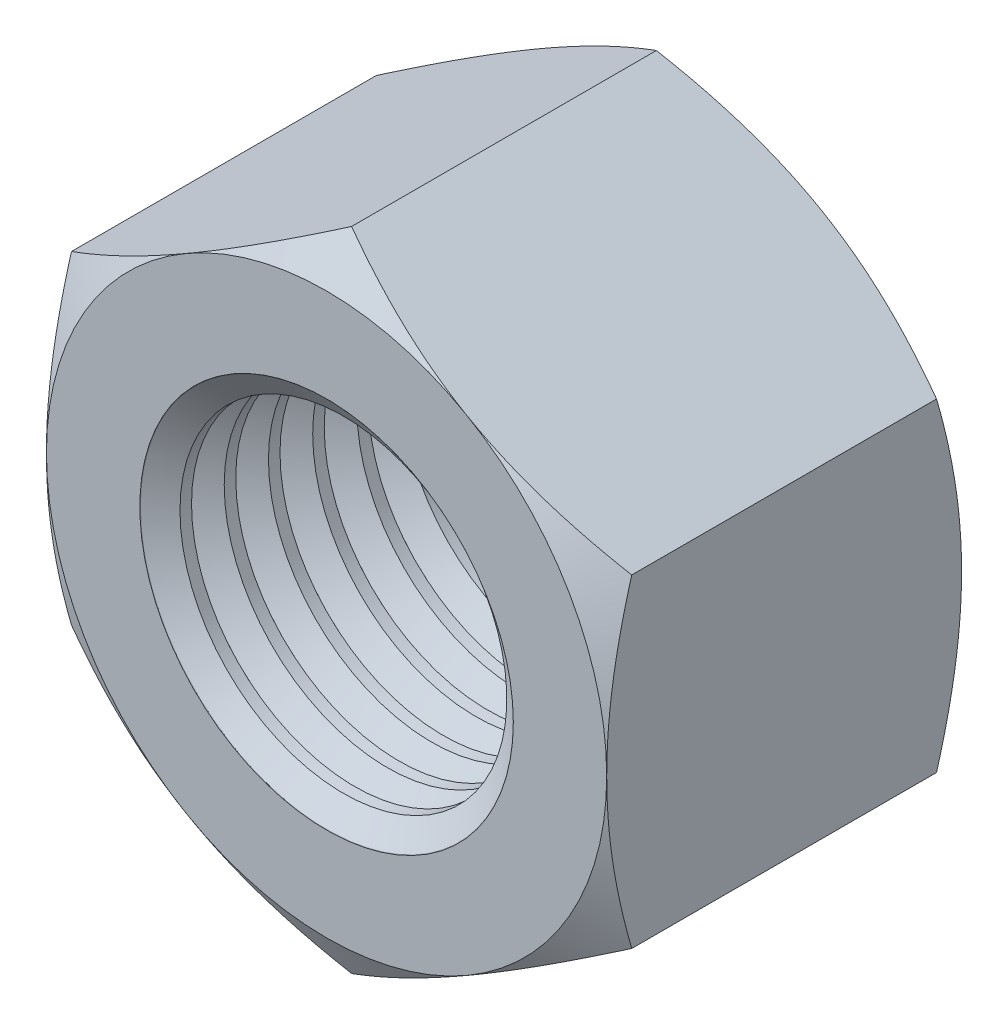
ISO-10303-21;
HEADER;
FILE_DESCRIPTION(('STEP AP214'),'2;1');
FILE_NAME('part.step','',(''),(''),'','','');
FILE_SCHEMA(('AUTOMOTIVE_DESIGN { 1 0 10303 214 1 1 1 1 }'));
ENDSEC;
DATA;
#1=APPLICATION_CONTEXT('core data for automotive mechanical design processes');
#2=APPLICATION_PROTOCOL_DEFINITION('international standard','automotive_design',2000,#1);
#3=PRODUCT_CONTEXT('',#1,'mechanical');
#4=PRODUCT('Part','Part','',(#3));
#5=PRODUCT_RELATED_PRODUCT_CATEGORY('part','',(#4));
#6=PRODUCT_DEFINITION_FORMATION('','',#4);
#7=PRODUCT_DEFINITION_CONTEXT('part definition',#1,'design');
#8=PRODUCT_DEFINITION('design','',#6,#7);
#9=PRODUCT_DEFINITION_SHAPE('','',#8);
#10=(LENGTH_UNIT() NAMED_UNIT(*) SI_UNIT(.MILLI.,.METRE.));
#11=(NAMED_UNIT(*) PLANE_ANGLE_UNIT() SI_UNIT($,.RADIAN.));
#12=(NAMED_UNIT(*) SI_UNIT($,.STERADIAN.) SOLID_ANGLE_UNIT());
#13=UNCERTAINTY_MEASURE_WITH_UNIT(LENGTH_MEASURE(1.E-05),#10,'distance_accuracy_value','');
#14=(GEOMETRIC_REPRESENTATION_CONTEXT(3) GLOBAL_UNCERTAINTY_ASSIGNED_CONTEXT((#13)) GLOBAL_UNIT_ASSIGNED_CONTEXT((#10,
#11,#12)) REPRESENTATION_CONTEXT('',''));
#15=CARTESIAN_POINT('',(0.,0.,0.));
#16=DIRECTION('',(0.,0.,1.));
#17=DIRECTION('',(1.,0.,0.));
#18=AXIS2_PLACEMENT_3D('',#15,#16,#17);
#19=CARTESIAN_POINT('',(0.,0.,-19.));
#20=DIRECTION('',(0.,0.,1.));
#21=DIRECTION('',(1.,0.,0.));
#22=AXIS2_PLACEMENT_3D('',#19,#20,#21);
#23=CYLINDRICAL_SURFACE('',#22,8.75);
#24=CARTESIAN_POINT('',(0.,0.,-17.4812094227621));
#25=DIRECTION('',(0.,0.,-1.));
#26=DIRECTION('',(-1.,0.,0.));
#27=AXIS2_PLACEMENT_3D('',#24,#25,#26);
#28=CIRCLE('',#27,8.75);
#29=CARTESIAN_POINT('',(-8.75,0.,-17.4812094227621));
#30=VERTEX_POINT('',#29);
#31=EDGE_CURVE('E378',#30,#30,#28,.T.);
#32=ORIENTED_EDGE('',*,*,#31,.F.);
#33=EDGE_LOOP('',(#32));
#34=FACE_BOUND('',#33,.T.);
#35=CARTESIAN_POINT('',(0.,0.,-18.0993405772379));
#36=DIRECTION('',(0.,0.,-1.));
#37=DIRECTION('',(-1.,0.,0.));
#38=AXIS2_PLACEMENT_3D('',#35,#36,#37);
#39=CIRCLE('',#38,8.75);
#40=CARTESIAN_POINT('',(-8.75,0.,-18.0993405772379));
#41=VERTEX_POINT('',#40);
#42=EDGE_CURVE('E168',#41,#41,#39,.F.);
#43=ORIENTED_EDGE('',*,*,#42,.F.);
#44=EDGE_LOOP('',(#43));
#45=FACE_BOUND('',#44,.T.);
#46=ADVANCED_FACE('F26',(#34,#45),#23,.F.);
#47=CARTESIAN_POINT('',(0.,0.,-15.7306905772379));
#48=DIRECTION('',(0.,0.,-1.));
#49=DIRECTION('',(-1.,0.,0.));
#50=AXIS2_PLACEMENT_3D('',#47,#48,#49);
#51=CIRCLE('',#50,8.75);
#52=CARTESIAN_POINT('',(-8.75,0.,-15.7306905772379));
#53=VERTEX_POINT('',#52);
#54=EDGE_CURVE('E381',#53,#53,#51,.T.);
#55=ORIENTED_EDGE('',*,*,#54,.T.);
#56=EDGE_LOOP('',(#55));
#57=FACE_BOUND('',#56,.T.);
#58=CARTESIAN_POINT('',(0.,0.,-15.1125594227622));
#59=DIRECTION('',(0.,0.,-1.));
#60=DIRECTION('',(-1.,0.,0.));
#61=AXIS2_PLACEMENT_3D('',#58,#59,#60);
#62=CIRCLE('',#61,8.75);
#63=CARTESIAN_POINT('',(-8.75,0.,-15.1125594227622));
#64=VERTEX_POINT('',#63);
#65=EDGE_CURVE('E369',#64,#64,#62,.T.);
#66=ORIENTED_EDGE('',*,*,#65,.F.);
#67=EDGE_LOOP('',(#66));
#68=FACE_BOUND('',#67,.T.);
#69=ADVANCED_FACE('F288',(#57,#68),#23,.F.);
#70=CARTESIAN_POINT('',(0.,0.,-13.3620405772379));
#71=DIRECTION('',(0.,0.,-1.));
#72=DIRECTION('',(-1.,0.,0.));
#73=AXIS2_PLACEMENT_3D('',#70,#71,#72);
#74=CIRCLE('',#73,8.75);
#75=CARTESIAN_POINT('',(-8.75,0.,-13.3620405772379));
#76=VERTEX_POINT('',#75);
#77=EDGE_CURVE('E372',#76,#76,#74,.T.);
#78=ORIENTED_EDGE('',*,*,#77,.T.);
#79=EDGE_LOOP('',(#78));
#80=FACE_BOUND('',#79,.T.);
#81=CARTESIAN_POINT('',(0.,0.,-12.7439094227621));
#82=DIRECTION('',(0.,0.,-1.));
#83=DIRECTION('',(-1.,0.,0.));
#84=AXIS2_PLACEMENT_3D('',#81,#82,#83);
#85=CIRCLE('',#84,8.75);
#86=CARTESIAN_POINT('',(-8.75,0.,-12.7439094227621));
#87=VERTEX_POINT('',#86);
#88=EDGE_CURVE('E360',#87,#87,#85,.T.);
#89=ORIENTED_EDGE('',*,*,#88,.F.);
#90=EDGE_LOOP('',(#89));
#91=FACE_BOUND('',#90,.T.);
#92=ADVANCED_FACE('F295',(#80,#91),#23,.F.);
#93=CARTESIAN_POINT('',(0.,0.,-10.9933905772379));
#94=DIRECTION('',(0.,0.,-1.));
#95=DIRECTION('',(-1.,0.,0.));
#96=AXIS2_PLACEMENT_3D('',#93,#94,#95);
#97=CIRCLE('',#96,8.75);
#98=CARTESIAN_POINT('',(-8.75,0.,-10.9933905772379));
#99=VERTEX_POINT('',#98);
#100=EDGE_CURVE('E363',#99,#99,#97,.T.);
#101=ORIENTED_EDGE('',*,*,#100,.T.);
#102=EDGE_LOOP('',(#101));
#103=FACE_BOUND('',#102,.T.);
#104=CARTESIAN_POINT('',(0.,0.,-10.3752594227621));
#105=DIRECTION('',(0.,0.,-1.));
#106=DIRECTION('',(-1.,0.,0.));
#107=AXIS2_PLACEMENT_3D('',#104,#105,#106);
#108=CIRCLE('',#107,8.75);
#109=CARTESIAN_POINT('',(-8.75,0.,-10.3752594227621));
#110=VERTEX_POINT('',#109);
#111=EDGE_CURVE('E351',#110,#110,#108,.T.);
#112=ORIENTED_EDGE('',*,*,#111,.F.);
#113=EDGE_LOOP('',(#112));
#114=FACE_BOUND('',#113,.T.);
#115=ADVANCED_FACE('F630',(#103,#114),#23,.F.);
#116=CARTESIAN_POINT('',(0.,0.,-8.62474057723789));
#117=DIRECTION('',(0.,0.,-1.));
#118=DIRECTION('',(-1.,0.,0.));
#119=AXIS2_PLACEMENT_3D('',#116,#117,#118);
#120=CIRCLE('',#119,8.75);
#121=CARTESIAN_POINT('',(-8.75,0.,-8.62474057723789));
#122=VERTEX_POINT('',#121);
#123=EDGE_CURVE('E354',#122,#122,#120,.T.);
#124=ORIENTED_EDGE('',*,*,#123,.T.);
#125=EDGE_LOOP('',(#124));
#126=FACE_BOUND('',#125,.T.);
#127=CARTESIAN_POINT('',(0.,0.,-8.00660942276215));
#128=DIRECTION('',(0.,0.,-1.));
#129=DIRECTION('',(-1.,0.,0.));
#130=AXIS2_PLACEMENT_3D('',#127,#128,#129);
#131=CIRCLE('',#130,8.75);
#132=CARTESIAN_POINT('',(-8.75,0.,-8.00660942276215));
#133=VERTEX_POINT('',#132);
#134=EDGE_CURVE('E342',#133,#133,#131,.T.);
#135=ORIENTED_EDGE('',*,*,#134,.F.);
#136=EDGE_LOOP('',(#135));
#137=FACE_BOUND('',#136,.T.);
#138=ADVANCED_FACE('F623',(#126,#137),#23,.F.);
#139=CARTESIAN_POINT('',(0.,0.,-6.25609057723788));
#140=DIRECTION('',(0.,0.,-1.));
#141=DIRECTION('',(-1.,0.,0.));
#142=AXIS2_PLACEMENT_3D('',#139,#140,#141);
#143=CIRCLE('',#142,8.75);
#144=CARTESIAN_POINT('',(-8.75,0.,-6.25609057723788));
#145=VERTEX_POINT('',#144);
#146=EDGE_CURVE('E345',#145,#145,#143,.T.);
#147=ORIENTED_EDGE('',*,*,#146,.T.);
#148=EDGE_LOOP('',(#147));
#149=FACE_BOUND('',#148,.T.);
#150=CARTESIAN_POINT('',(0.,0.,-5.63795942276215));
#151=DIRECTION('',(0.,0.,-1.));
#152=DIRECTION('',(-1.,0.,0.));
#153=AXIS2_PLACEMENT_3D('',#150,#151,#152);
#154=CIRCLE('',#153,8.75);
#155=CARTESIAN_POINT('',(-8.75,0.,-5.63795942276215));
#156=VERTEX_POINT('',#155);
#157=EDGE_CURVE('E333',#156,#156,#154,.T.);
#158=ORIENTED_EDGE('',*,*,#157,.F.);
#159=EDGE_LOOP('',(#158));
#160=FACE_BOUND('',#159,.T.);
#161=ADVANCED_FACE('F309',(#149,#160),#23,.F.);
#162=CARTESIAN_POINT('',(0.,0.,-3.88744057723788));
#163=DIRECTION('',(0.,0.,-1.));
#164=DIRECTION('',(-1.,0.,0.));
#165=AXIS2_PLACEMENT_3D('',#162,#163,#164);
#166=CIRCLE('',#165,8.75);
#167=CARTESIAN_POINT('',(-8.75,0.,-3.88744057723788));
#168=VERTEX_POINT('',#167);
#169=EDGE_CURVE('E336',#168,#168,#166,.T.);
#170=ORIENTED_EDGE('',*,*,#169,.T.);
#171=EDGE_LOOP('',(#170));
#172=FACE_BOUND('',#171,.T.);
#173=CARTESIAN_POINT('',(0.,0.,-3.26930942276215));
#174=DIRECTION('',(0.,0.,-1.));
#175=DIRECTION('',(-1.,0.,0.));
#176=AXIS2_PLACEMENT_3D('',#173,#174,#175);
#177=CIRCLE('',#176,8.75);
#178=CARTESIAN_POINT('',(-8.75,0.,-3.26930942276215));
#179=VERTEX_POINT('',#178);
#180=EDGE_CURVE('E324',#179,#179,#177,.T.);
#181=ORIENTED_EDGE('',*,*,#180,.F.);
#182=EDGE_LOOP('',(#181));
#183=FACE_BOUND('',#182,.T.);
#184=ADVANCED_FACE('F300',(#172,#183),#23,.F.);
#185=CARTESIAN_POINT('',(0.,0.,-1.51879057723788));
#186=DIRECTION('',(0.,0.,-1.));
#187=DIRECTION('',(-1.,0.,0.));
#188=AXIS2_PLACEMENT_3D('',#185,#186,#187);
#189=CIRCLE('',#188,8.75);
#190=CARTESIAN_POINT('',(-8.75,0.,-1.51879057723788));
#191=VERTEX_POINT('',#190);
#192=EDGE_CURVE('E314',#191,#191,#189,.T.);
#193=ORIENTED_EDGE('',*,*,#192,.T.);
#194=EDGE_LOOP('',(#193));
#195=FACE_BOUND('',#194,.T.);
#196=CARTESIAN_POINT('',(0.,0.,-0.900659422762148));
#197=DIRECTION('',(0.,0.,-1.));
#198=DIRECTION('',(-1.,0.,0.));
#199=AXIS2_PLACEMENT_3D('',#196,#197,#198);
#200=CIRCLE('',#199,8.75);
#201=CARTESIAN_POINT('',(-8.75,0.,-0.900659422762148));
#202=VERTEX_POINT('',#201);
#203=EDGE_CURVE('E317',#202,#202,#200,.T.);
#204=ORIENTED_EDGE('',*,*,#203,.F.);
#205=EDGE_LOOP('',(#204));
#206=FACE_BOUND('',#205,.T.);
#207=ADVANCED_FACE('F290',(#195,#206),#23,.F.);
#208=CARTESIAN_POINT('',(0.,17.3205080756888,-19.));
#209=DIRECTION('',(0.,0.,-1.));
#210=DIRECTION('',(-1.,0.,0.));
#211=AXIS2_PLACEMENT_3D('',#208,#209,#210);
#212=PLANE('',#211);
#213=CARTESIAN_POINT('',(0.,0.,-19.));
#214=DIRECTION('',(0.,0.,-1.));
#215=DIRECTION('',(-1.,0.,0.));
#216=AXIS2_PLACEMENT_3D('',#213,#214,#215);
#217=CIRCLE('',#216,15.);
#218=CARTESIAN_POINT('',(-15.,0.,-19.));
#219=VERTEX_POINT('',#218);
#220=CARTESIAN_POINT('',(-7.50000000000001,-12.9903810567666,-19.));
#221=VERTEX_POINT('',#220);
#222=EDGE_CURVE('E162',#219,#221,#217,.F.);
#223=ORIENTED_EDGE('',*,*,#222,.F.);
#224=CARTESIAN_POINT('',(-7.50000000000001,12.9903810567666,-19.));
#225=VERTEX_POINT('',#224);
#226=EDGE_CURVE('E144',#225,#219,#217,.F.);
#227=ORIENTED_EDGE('',*,*,#226,.F.);
#228=CARTESIAN_POINT('',(7.50000000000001,12.9903810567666,-19.));
#229=VERTEX_POINT('',#228);
#230=EDGE_CURVE('E161',#229,#225,#217,.F.);
#231=ORIENTED_EDGE('',*,*,#230,.F.);
#232=CARTESIAN_POINT('',(0.,0.,-19.));
#233=DIRECTION('',(0.,0.,1.));
#234=DIRECTION('',(1.,0.,0.));
#235=AXIS2_PLACEMENT_3D('',#232,#233,#234);
#236=CIRCLE('',#235,15.);
#237=CARTESIAN_POINT('',(15.,0.,-19.));
#238=VERTEX_POINT('',#237);
#239=EDGE_CURVE('E235',#238,#229,#236,.T.);
#240=ORIENTED_EDGE('',*,*,#239,.F.);
#241=CARTESIAN_POINT('',(7.50000000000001,-12.9903810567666,-19.));
#242=VERTEX_POINT('',#241);
#243=EDGE_CURVE('E529',#242,#238,#217,.F.);
#244=ORIENTED_EDGE('',*,*,#243,.F.);
#245=EDGE_CURVE('E550',#221,#242,#217,.F.);
#246=ORIENTED_EDGE('',*,*,#245,.F.);
#247=EDGE_LOOP('',(#223,#227,#231,#240,#244,#246));
#248=FACE_BOUND('',#247,.T.);
#249=CARTESIAN_POINT('',(0.,0.,-19.));
#250=DIRECTION('',(0.,0.,-1.));
#251=DIRECTION('',(-1.,0.,0.));
#252=AXIS2_PLACEMENT_3D('',#249,#250,#251);
#253=CIRCLE('',#252,10.);
#254=CARTESIAN_POINT('',(-10.,0.,-19.));
#255=VERTEX_POINT('',#254);
#256=EDGE_CURVE('E166',#255,#255,#253,.F.);
#257=ORIENTED_EDGE('',*,*,#256,.T.);
#258=EDGE_LOOP('',(#257));
#259=FACE_BOUND('',#258,.T.);
#260=ADVANCED_FACE('F240',(#248,#259),#212,.T.);
#261=CARTESIAN_POINT('',(0.,17.3205080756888,0.));
#262=DIRECTION('',(0.,0.,-1.));
#263=DIRECTION('',(-1.,0.,0.));
#264=AXIS2_PLACEMENT_3D('',#261,#262,#263);
#265=PLANE('',#264);
#266=CARTESIAN_POINT('',(0.,0.,0.));
#267=DIRECTION('',(0.,0.,-1.));
#268=DIRECTION('',(-1.,0.,0.));
#269=AXIS2_PLACEMENT_3D('',#266,#267,#268);
#270=CIRCLE('',#269,15.);
#271=CARTESIAN_POINT('',(-15.,0.,0.));
#272=VERTEX_POINT('',#271);
#273=CARTESIAN_POINT('',(-7.50000000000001,12.9903810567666,0.));
#274=VERTEX_POINT('',#273);
#275=EDGE_CURVE('E11',#272,#274,#270,.T.);
#276=ORIENTED_EDGE('',*,*,#275,.F.);
#277=CARTESIAN_POINT('',(-7.50000000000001,-12.9903810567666,0.));
#278=VERTEX_POINT('',#277);
#279=EDGE_CURVE('E38',#278,#272,#270,.T.);
#280=ORIENTED_EDGE('',*,*,#279,.F.);
#281=CARTESIAN_POINT('',(7.50000000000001,-12.9903810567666,0.));
#282=VERTEX_POINT('',#281);
#283=EDGE_CURVE('E165',#282,#278,#270,.T.);
#284=ORIENTED_EDGE('',*,*,#283,.F.);
#285=CARTESIAN_POINT('',(15.,0.,0.));
#286=VERTEX_POINT('',#285);
#287=EDGE_CURVE('E487',#286,#282,#270,.T.);
#288=ORIENTED_EDGE('',*,*,#287,.F.);
#289=CARTESIAN_POINT('',(0.,0.,0.));
#290=DIRECTION('',(0.,0.,1.));
#291=DIRECTION('',(1.,0.,0.));
#292=AXIS2_PLACEMENT_3D('',#289,#290,#291);
#293=CIRCLE('',#292,15.);
#294=CARTESIAN_POINT('',(7.50000000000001,12.9903810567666,0.));
#295=VERTEX_POINT('',#294);
#296=EDGE_CURVE('E120',#286,#295,#293,.T.);
#297=ORIENTED_EDGE('',*,*,#296,.T.);
#298=EDGE_CURVE('E36',#274,#295,#270,.T.);
#299=ORIENTED_EDGE('',*,*,#298,.F.);
#300=EDGE_LOOP('',(#276,#280,#284,#288,#297,#299));
#301=FACE_BOUND('',#300,.T.);
#302=CARTESIAN_POINT('',(0.,0.,0.));
#303=DIRECTION('',(0.,0.,1.));
#304=DIRECTION('',(1.,0.,0.));
#305=AXIS2_PLACEMENT_3D('',#302,#303,#304);
#306=CIRCLE('',#305,10.);
#307=CARTESIAN_POINT('',(10.,0.,0.));
#308=VERTEX_POINT('',#307);
#309=EDGE_CURVE('E171',#308,#308,#306,.T.);
#310=ORIENTED_EDGE('',*,*,#309,.F.);
#311=EDGE_LOOP('',(#310));
#312=FACE_BOUND('',#311,.T.);
#313=ADVANCED_FACE('F307',(#301,#312),#265,.F.);
#314=CARTESIAN_POINT('',(0.,17.3205080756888,-19.));
#315=DIRECTION('',(-0.5,0.866025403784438,0.));
#316=DIRECTION('',(-0.866025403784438,-0.500000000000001,0.));
#317=AXIS2_PLACEMENT_3D('',#314,#315,#316);
#318=PLANE('',#317);
#319=DIRECTION('',(0.,0.,1.));
#320=VECTOR('',#319,1.);
#321=CARTESIAN_POINT('',(-15.,8.66025403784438,-19.));
#322=LINE('',#321,#320);
#323=CARTESIAN_POINT('',(-15.,8.6602540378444,-17.6602540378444));
#324=VERTEX_POINT('',#323);
#325=CARTESIAN_POINT('',(-15.,8.66025403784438,-1.33974596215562));
#326=VERTEX_POINT('',#325);
#327=EDGE_CURVE('E156',#324,#326,#322,.T.);
#328=ORIENTED_EDGE('',*,*,#327,.T.);
#329=CARTESIAN_POINT('',(-15.0002,8.66013856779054,-1.33981262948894));
#330=CARTESIAN_POINT('',(-14.6705058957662,8.85048754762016,-1.22992178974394));
#331=CARTESIAN_POINT('',(-14.3395258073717,9.04157899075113,-1.12501758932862));
#332=CARTESIAN_POINT('',(-13.674911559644,9.42529420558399,-0.926568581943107));
#333=CARTESIAN_POINT('',(-13.3412765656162,9.61791845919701,-0.833027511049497));
#334=CARTESIAN_POINT('',(-12.6707077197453,10.0050715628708,-0.658562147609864));
#335=CARTESIAN_POINT('',(-12.333767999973,10.199603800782,-0.577667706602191));
#336=CARTESIAN_POINT('',(-11.6575472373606,10.5900200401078,-0.430232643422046));
#337=CARTESIAN_POINT('',(-11.3182663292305,10.7859039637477,-0.363691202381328));
#338=CARTESIAN_POINT('',(-10.6460568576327,11.1740042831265,-0.247792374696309));
#339=CARTESIAN_POINT('',(-10.3131781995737,11.3661918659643,-0.198051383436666));
#340=CARTESIAN_POINT('',(-9.6458955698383,11.7514476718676,-0.114646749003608));
#341=CARTESIAN_POINT('',(-9.3114915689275,11.9445159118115,-0.0809834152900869));
#342=CARTESIAN_POINT('',(-8.64212181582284,12.3309767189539,-0.0305840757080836));
#343=CARTESIAN_POINT('',(-8.30715720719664,12.5243686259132,-0.0138279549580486));
#344=CARTESIAN_POINT('',(-7.63691878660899,12.9113309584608,0.00239660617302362));
#345=CARTESIAN_POINT('',(-7.30164498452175,13.1049013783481,0.00186558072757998));
#346=CARTESIAN_POINT('',(-6.67485311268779,13.4667798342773,-0.0152766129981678));
#347=CARTESIAN_POINT('',(-6.38329037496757,13.6351136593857,-0.0297968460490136));
#348=CARTESIAN_POINT('',(-5.80083556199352,13.9713941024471,-0.0716371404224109));
#349=CARTESIAN_POINT('',(-5.50994353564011,14.1393406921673,-0.098958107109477));
#350=CARTESIAN_POINT('',(-4.92898814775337,14.4747554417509,-0.165923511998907));
#351=CARTESIAN_POINT('',(-4.63892567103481,14.6422230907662,-0.205578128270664));
#352=CARTESIAN_POINT('',(-4.06016058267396,14.9763732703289,-0.296515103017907));
#353=CARTESIAN_POINT('',(-3.77145806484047,15.1430557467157,-0.347798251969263));
#354=CARTESIAN_POINT('',(-2.89508556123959,15.6490296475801,-0.520386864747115));
#355=CARTESIAN_POINT('',(-2.30995340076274,15.9868558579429,-0.658901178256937));
#356=CARTESIAN_POINT('',(-1.14841408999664,16.6574708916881,-0.973271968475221));
#357=CARTESIAN_POINT('',(-0.571992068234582,16.9902683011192,-1.14905461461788));
#358=CARTESIAN_POINT('',(0.000200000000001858,17.3206235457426,-1.33981262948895));
#359=B_SPLINE_CURVE_WITH_KNOTS('',3,(#329,#330,#331,#332,#333,#334,#335,#336,#337,#338,#339,
#340,#341,#342,#343,#344,#345,#346,#347,#348,#349,#350,#351,#352,#353,#354,#355,#356,#357,#358),
.UNSPECIFIED.,.F.,.F.,(4,2,2,2,2,2,2,2,2,2,2,2,2,2,4),(0.,1.18875411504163,2.37789802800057,
3.56980778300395,4.76164951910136,5.92407379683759,7.08652044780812,8.24758247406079,
9.40860862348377,10.4193068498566,11.4300765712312,12.4416826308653,13.4533574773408,
15.5211962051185,17.5849760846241),.UNSPECIFIED.);
#360=EDGE_CURVE('E125',#326,#274,#359,.T.);
#361=ORIENTED_EDGE('',*,*,#360,.T.);
#362=CARTESIAN_POINT('',(0.,17.3205080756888,-1.33974596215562));
#363=VERTEX_POINT('',#362);
#364=EDGE_CURVE('E45',#274,#363,#359,.T.);
#365=ORIENTED_EDGE('',*,*,#364,.T.);
#366=DIRECTION('',(0.,0.,1.));
#367=VECTOR('',#366,1.);
#368=CARTESIAN_POINT('',(0.,17.3205080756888,-19.));
#369=LINE('',#368,#367);
#370=CARTESIAN_POINT('',(0.,17.3205080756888,-17.6602540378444));
#371=VERTEX_POINT('',#370);
#372=EDGE_CURVE('E141',#371,#363,#369,.T.);
#373=ORIENTED_EDGE('',*,*,#372,.F.);
#374=CARTESIAN_POINT('',(-15.0002,8.66013856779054,-17.6601873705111));
#375=CARTESIAN_POINT('',(-14.6705058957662,8.85048754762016,-17.7700782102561));
#376=CARTESIAN_POINT('',(-14.3395258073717,9.04157899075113,-17.8749824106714));
#377=CARTESIAN_POINT('',(-13.674911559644,9.42529420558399,-18.0734314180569));
#378=CARTESIAN_POINT('',(-13.3412765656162,9.61791845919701,-18.1669724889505));
#379=CARTESIAN_POINT('',(-12.6707077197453,10.0050715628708,-18.3414378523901));
#380=CARTESIAN_POINT('',(-12.333767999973,10.199603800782,-18.4223322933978));
#381=CARTESIAN_POINT('',(-11.6575472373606,10.5900200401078,-18.569767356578));
#382=CARTESIAN_POINT('',(-11.3182663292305,10.7859039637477,-18.6363087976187));
#383=CARTESIAN_POINT('',(-10.6460568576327,11.1740042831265,-18.7522076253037));
#384=CARTESIAN_POINT('',(-10.3131781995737,11.3661918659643,-18.8019486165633));
#385=CARTESIAN_POINT('',(-9.6458955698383,11.7514476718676,-18.8853532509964));
#386=CARTESIAN_POINT('',(-9.3114915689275,11.9445159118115,-18.9190165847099));
#387=CARTESIAN_POINT('',(-8.64212181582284,12.3309767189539,-18.9694159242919));
#388=CARTESIAN_POINT('',(-8.30715720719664,12.5243686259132,-18.986172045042));
#389=CARTESIAN_POINT('',(-7.63691878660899,12.9113309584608,-19.002396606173));
#390=CARTESIAN_POINT('',(-7.30164498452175,13.1049013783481,-19.0018655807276));
#391=CARTESIAN_POINT('',(-6.67485311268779,13.4667798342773,-18.9847233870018));
#392=CARTESIAN_POINT('',(-6.38329037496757,13.6351136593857,-18.970203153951));
#393=CARTESIAN_POINT('',(-5.80083556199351,13.9713941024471,-18.9283628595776));
#394=CARTESIAN_POINT('',(-5.50994353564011,14.1393406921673,-18.9010418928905));
#395=CARTESIAN_POINT('',(-4.92898814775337,14.4747554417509,-18.8340764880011));
#396=CARTESIAN_POINT('',(-4.63892567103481,14.6422230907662,-18.7944218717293));
#397=CARTESIAN_POINT('',(-4.06016058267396,14.9763732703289,-18.7034848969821));
#398=CARTESIAN_POINT('',(-3.77145806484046,15.1430557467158,-18.6522017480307));
#399=CARTESIAN_POINT('',(-2.89508556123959,15.6490296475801,-18.4796131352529));
#400=CARTESIAN_POINT('',(-2.30995340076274,15.9868558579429,-18.3410988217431));
#401=CARTESIAN_POINT('',(-1.14841408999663,16.6574708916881,-18.0267280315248));
#402=CARTESIAN_POINT('',(-0.571992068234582,16.9902683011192,-17.8509453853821));
#403=CARTESIAN_POINT('',(0.000200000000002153,17.3206235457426,-17.660187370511));
#404=B_SPLINE_CURVE_WITH_KNOTS('',3,(#374,#375,#376,#377,#378,#379,#380,#381,#382,#383,#384,
#385,#386,#387,#388,#389,#390,#391,#392,#393,#394,#395,#396,#397,#398,#399,#400,#401,#402,#403),
.UNSPECIFIED.,.F.,.F.,(4,2,2,2,2,2,2,2,2,2,2,2,2,2,4),(0.,1.18875411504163,2.37789802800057,
3.56980778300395,4.76164951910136,5.92407379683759,7.08652044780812,8.24758247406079,
9.40860862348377,10.4193068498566,11.4300765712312,12.4416826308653,13.4533574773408,
15.5211962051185,17.5849760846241),.UNSPECIFIED.);
#405=EDGE_CURVE('E159',#225,#371,#404,.T.);
#406=ORIENTED_EDGE('',*,*,#405,.F.);
#407=EDGE_CURVE('E250',#324,#225,#404,.T.);
#408=ORIENTED_EDGE('',*,*,#407,.F.);
#409=EDGE_LOOP('',(#328,#361,#365,#373,#406,#408));
#410=FACE_BOUND('',#409,.T.);
#411=ADVANCED_FACE('F28',(#410),#318,.T.);
#412=CARTESIAN_POINT('',(15.,8.66025403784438,-19.));
#413=DIRECTION('',(0.500000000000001,0.866025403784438,0.));
#414=DIRECTION('',(-0.866025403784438,0.500000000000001,0.));
#415=AXIS2_PLACEMENT_3D('',#412,#413,#414);
#416=PLANE('',#415);
#417=ORIENTED_EDGE('',*,*,#372,.T.);
#418=CARTESIAN_POINT('',(-0.000199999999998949,17.3206235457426,-1.33981262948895));
#419=CARTESIAN_POINT('',(0.329494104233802,17.130274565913,-1.22992178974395));
#420=CARTESIAN_POINT('',(0.660474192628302,16.939183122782,-1.12501758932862));
#421=CARTESIAN_POINT('',(1.32508844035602,16.5554679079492,-0.926568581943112));
#422=CARTESIAN_POINT('',(1.6587234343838,16.3628436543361,-0.833027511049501));
#423=CARTESIAN_POINT('',(2.32929228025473,15.9756905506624,-0.658562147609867));
#424=CARTESIAN_POINT('',(2.66623200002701,15.7811583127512,-0.577667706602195));
#425=CARTESIAN_POINT('',(3.34245276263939,15.3907420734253,-0.430232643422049));
#426=CARTESIAN_POINT('',(3.68173367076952,15.1948581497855,-0.36369120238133));
#427=CARTESIAN_POINT('',(4.35394314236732,14.8067578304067,-0.24779237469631));
#428=CARTESIAN_POINT('',(4.68682180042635,14.6145702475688,-0.198051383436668));
#429=CARTESIAN_POINT('',(5.3541044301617,14.2293144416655,-0.114646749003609));
#430=CARTESIAN_POINT('',(5.6885084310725,14.0362462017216,-0.0809834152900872));
#431=CARTESIAN_POINT('',(6.35787818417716,13.6497853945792,-0.0305840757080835));
#432=CARTESIAN_POINT('',(6.69284279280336,13.4563934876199,-0.0138279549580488));
#433=CARTESIAN_POINT('',(7.36308121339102,13.0694311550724,0.00239660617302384));
#434=CARTESIAN_POINT('',(7.69835501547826,12.8758607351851,0.00186558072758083));
#435=CARTESIAN_POINT('',(8.32514688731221,12.5139822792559,-0.0152766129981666));
#436=CARTESIAN_POINT('',(8.61670962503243,12.3456484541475,-0.0297968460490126));
#437=CARTESIAN_POINT('',(9.19916443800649,12.0093680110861,-0.0716371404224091));
#438=CARTESIAN_POINT('',(9.4900564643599,11.8414214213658,-0.0989581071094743));
#439=CARTESIAN_POINT('',(10.0710118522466,11.5060066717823,-0.165923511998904));
#440=CARTESIAN_POINT('',(10.3610743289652,11.338539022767,-0.205578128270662));
#441=CARTESIAN_POINT('',(10.939839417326,11.0043888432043,-0.296515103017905));
#442=CARTESIAN_POINT('',(11.2285419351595,10.8377063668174,-0.347798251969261));
#443=CARTESIAN_POINT('',(12.1049144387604,10.3317324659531,-0.520386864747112));
#444=CARTESIAN_POINT('',(12.6900465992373,9.99390625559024,-0.658901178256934));
#445=CARTESIAN_POINT('',(13.8515859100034,9.3232912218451,-0.973271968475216));
#446=CARTESIAN_POINT('',(14.4280079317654,8.99049381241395,-1.14905461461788));
#447=CARTESIAN_POINT('',(15.0002,8.66013856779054,-1.33981262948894));
#448=B_SPLINE_CURVE_WITH_KNOTS('',3,(#418,#419,#420,#421,#422,#423,#424,#425,#426,#427,#428,
#429,#430,#431,#432,#433,#434,#435,#436,#437,#438,#439,#440,#441,#442,#443,#444,#445,#446,#447),
.UNSPECIFIED.,.F.,.F.,(4,2,2,2,2,2,2,2,2,2,2,2,2,2,4),(0.,1.18875411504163,2.37789802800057,
3.56980778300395,4.76164951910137,5.92407379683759,7.08652044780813,8.24758247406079,
9.40860862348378,10.4193068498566,11.4300765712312,12.4416826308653,13.4533574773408,
15.5211962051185,17.5849760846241),.UNSPECIFIED.);
#449=EDGE_CURVE('E135',#363,#295,#448,.T.);
#450=ORIENTED_EDGE('',*,*,#449,.T.);
#451=CARTESIAN_POINT('',(15.,8.6602540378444,-1.33974596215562));
#452=VERTEX_POINT('',#451);
#453=EDGE_CURVE('E52',#295,#452,#448,.T.);
#454=ORIENTED_EDGE('',*,*,#453,.T.);
#455=DIRECTION('',(0.,0.,1.));
#456=VECTOR('',#455,1.);
#457=CARTESIAN_POINT('',(15.,8.66025403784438,-19.));
#458=LINE('',#457,#456);
#459=CARTESIAN_POINT('',(15.,8.6602540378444,-17.6602540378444));
#460=VERTEX_POINT('',#459);
#461=EDGE_CURVE('E134',#460,#452,#458,.T.);
#462=ORIENTED_EDGE('',*,*,#461,.F.);
#463=CARTESIAN_POINT('',(-0.000199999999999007,17.3206235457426,-17.660187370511));
#464=CARTESIAN_POINT('',(0.3294941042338,17.130274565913,-17.7700782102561));
#465=CARTESIAN_POINT('',(0.660474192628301,16.939183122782,-17.8749824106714));
#466=CARTESIAN_POINT('',(1.32508844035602,16.5554679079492,-18.0734314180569));
#467=CARTESIAN_POINT('',(1.6587234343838,16.3628436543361,-18.1669724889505));
#468=CARTESIAN_POINT('',(2.32929228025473,15.9756905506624,-18.3414378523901));
#469=CARTESIAN_POINT('',(2.66623200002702,15.7811583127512,-18.4223322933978));
#470=CARTESIAN_POINT('',(3.34245276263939,15.3907420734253,-18.569767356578));
#471=CARTESIAN_POINT('',(3.68173367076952,15.1948581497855,-18.6363087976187));
#472=CARTESIAN_POINT('',(4.35394314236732,14.8067578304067,-18.7522076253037));
#473=CARTESIAN_POINT('',(4.68682180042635,14.6145702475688,-18.8019486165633));
#474=CARTESIAN_POINT('',(5.3541044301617,14.2293144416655,-18.8853532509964));
#475=CARTESIAN_POINT('',(5.6885084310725,14.0362462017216,-18.9190165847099));
#476=CARTESIAN_POINT('',(6.35787818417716,13.6497853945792,-18.9694159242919));
#477=CARTESIAN_POINT('',(6.69284279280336,13.4563934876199,-18.986172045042));
#478=CARTESIAN_POINT('',(7.36308121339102,13.0694311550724,-19.002396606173));
#479=CARTESIAN_POINT('',(7.69835501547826,12.8758607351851,-19.0018655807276));
#480=CARTESIAN_POINT('',(8.32514688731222,12.5139822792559,-18.9847233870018));
#481=CARTESIAN_POINT('',(8.61670962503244,12.3456484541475,-18.970203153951));
#482=CARTESIAN_POINT('',(9.19916443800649,12.0093680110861,-18.9283628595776));
#483=CARTESIAN_POINT('',(9.4900564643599,11.8414214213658,-18.9010418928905));
#484=CARTESIAN_POINT('',(10.0710118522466,11.5060066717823,-18.8340764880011));
#485=CARTESIAN_POINT('',(10.3610743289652,11.338539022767,-18.7944218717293));
#486=CARTESIAN_POINT('',(10.939839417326,11.0043888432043,-18.7034848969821));
#487=CARTESIAN_POINT('',(11.2285419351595,10.8377063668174,-18.6522017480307));
#488=CARTESIAN_POINT('',(12.1049144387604,10.3317324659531,-18.4796131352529));
#489=CARTESIAN_POINT('',(12.6900465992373,9.99390625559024,-18.3410988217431));
#490=CARTESIAN_POINT('',(13.8515859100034,9.3232912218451,-18.0267280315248));
#491=CARTESIAN_POINT('',(14.4280079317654,8.99049381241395,-17.8509453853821));
#492=CARTESIAN_POINT('',(15.0002,8.66013856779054,-17.6601873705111));
#493=B_SPLINE_CURVE_WITH_KNOTS('',3,(#463,#464,#465,#466,#467,#468,#469,#470,#471,#472,#473,
#474,#475,#476,#477,#478,#479,#480,#481,#482,#483,#484,#485,#486,#487,#488,#489,#490,#491,#492),
.UNSPECIFIED.,.F.,.F.,(4,2,2,2,2,2,2,2,2,2,2,2,2,2,4),(0.,1.18875411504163,2.37789802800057,
3.56980778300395,4.76164951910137,5.92407379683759,7.08652044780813,8.2475824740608,
9.40860862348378,10.4193068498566,11.4300765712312,12.4416826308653,13.4533574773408,
15.5211962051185,17.5849760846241),.UNSPECIFIED.);
#494=EDGE_CURVE('E244',#229,#460,#493,.T.);
#495=ORIENTED_EDGE('',*,*,#494,.F.);
#496=EDGE_CURVE('E249',#371,#229,#493,.T.);
#497=ORIENTED_EDGE('',*,*,#496,.F.);
#498=EDGE_LOOP('',(#417,#450,#454,#462,#495,#497));
#499=FACE_BOUND('',#498,.T.);
#500=ADVANCED_FACE('F132',(#499),#416,.T.);
#501=CARTESIAN_POINT('',(15.,8.66025403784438,-19.));
#502=DIRECTION('',(-1.,0.,0.));
#503=DIRECTION('',(0.,0.,1.));
#504=AXIS2_PLACEMENT_3D('',#501,#502,#503);
#505=PLANE('',#504);
#506=CARTESIAN_POINT('',(15.,-22.9682699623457,-7.17790057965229));
#507=CARTESIAN_POINT('',(15.,-22.6389897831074,-7.01873142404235));
#508=CARTESIAN_POINT('',(15.,-22.3093116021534,-6.8603860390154));
#509=CARTESIAN_POINT('',(15.,-21.6490751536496,-6.54553189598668));
#510=CARTESIAN_POINT('',(15.,-21.3185168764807,-6.38902315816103));
#511=CARTESIAN_POINT('',(15.,-20.3252989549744,-5.92249019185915));
#512=CARTESIAN_POINT('',(15.,-19.6612032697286,-5.61551110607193));
#513=CARTESIAN_POINT('',(15.,-18.3246226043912,-5.0098985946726));
#514=CARTESIAN_POINT('',(15.,-17.6521113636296,-4.71132298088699));
#515=CARTESIAN_POINT('',(15.,-16.3015621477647,-4.12699119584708));
#516=CARTESIAN_POINT('',(15.,-15.6235244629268,-3.84123435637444));
#517=CARTESIAN_POINT('',(15.,-14.2524269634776,-3.28256457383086));
#518=CARTESIAN_POINT('',(15.,-13.5592849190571,-3.0098523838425));
#519=CARTESIAN_POINT('',(15.,-12.1648203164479,-2.48578579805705));
#520=CARTESIAN_POINT('',(15.,-11.4634968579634,-2.2344337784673));
#521=CARTESIAN_POINT('',(15.,-10.0530172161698,-1.75984469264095));
#522=CARTESIAN_POINT('',(15.,-9.34388131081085,-1.53654785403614));
#523=CARTESIAN_POINT('',(15.,-7.915459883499,-1.12531011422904));
#524=CARTESIAN_POINT('',(15.,-7.19617764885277,-0.937358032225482));
#525=CARTESIAN_POINT('',(15.,-6.10950776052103,-0.688818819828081));
#526=CARTESIAN_POINT('',(15.,-5.74591626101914,-0.611524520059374));
#527=CARTESIAN_POINT('',(15.,-5.01631310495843,-0.469286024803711));
#528=CARTESIAN_POINT('',(15.,-4.65030150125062,-0.404341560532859));
#529=CARTESIAN_POINT('',(15.,-3.91609659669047,-0.287952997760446));
#530=CARTESIAN_POINT('',(15.,-3.54790312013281,-0.236510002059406));
#531=CARTESIAN_POINT('',(15.,-2.80977894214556,-0.148161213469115));
#532=CARTESIAN_POINT('',(15.,-2.43984831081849,-0.111254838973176));
#533=CARTESIAN_POINT('',(15.,-1.70111543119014,-0.0529692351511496));
#534=CARTESIAN_POINT('',(15.,-1.3323208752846,-0.0314931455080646));
#535=CARTESIAN_POINT('',(15.,-0.594154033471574,-0.00418216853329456));
#536=CARTESIAN_POINT('',(15.,-0.224781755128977,0.00165292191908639));
#537=CARTESIAN_POINT('',(15.,0.513772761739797,-0.00245653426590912));
#538=CARTESIAN_POINT('',(15.,0.882955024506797,-0.0123966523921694));
#539=CARTESIAN_POINT('',(15.,1.62057875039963,-0.047809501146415));
#540=CARTESIAN_POINT('',(15.,1.98902017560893,-0.0732830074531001));
#541=CARTESIAN_POINT('',(15.,2.88200878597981,-0.153315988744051));
#542=CARTESIAN_POINT('',(15.,3.40586988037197,-0.215658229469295));
#543=CARTESIAN_POINT('',(15.,4.44957771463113,-0.368284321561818));
#544=CARTESIAN_POINT('',(15.,4.96942331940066,-0.458575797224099));
#545=CARTESIAN_POINT('',(15.,6.00467140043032,-0.663898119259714));
#546=CARTESIAN_POINT('',(15.,6.52006919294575,-0.77895235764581));
#547=CARTESIAN_POINT('',(15.,7.54556200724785,-1.030289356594));
#548=CARTESIAN_POINT('',(15.,8.0556575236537,-1.1665701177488));
#549=CARTESIAN_POINT('',(15.,9.08310964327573,-1.46066370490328));
#550=CARTESIAN_POINT('',(15.,9.60033774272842,-1.61892244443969));
#551=CARTESIAN_POINT('',(15.,10.6293258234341,-1.95107200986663));
#552=CARTESIAN_POINT('',(15.,11.1410893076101,-2.12495205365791));
#553=CARTESIAN_POINT('',(15.,12.1570993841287,-2.48477464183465));
#554=CARTESIAN_POINT('',(15.,12.6613720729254,-2.67064378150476));
#555=CARTESIAN_POINT('',(15.,13.4147912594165,-2.95756327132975));
#556=CARTESIAN_POINT('',(15.,13.6654863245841,-3.05457748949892));
#557=CARTESIAN_POINT('',(15.,14.1659013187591,-3.25107322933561));
#558=CARTESIAN_POINT('',(15.,14.4156212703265,-3.35055469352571));
#559=CARTESIAN_POINT('',(15.,14.6648887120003,-3.45115877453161));
#560=B_SPLINE_CURVE_WITH_KNOTS('',3,(#506,#507,#508,#509,#510,#511,#512,#513,#514,#515,#516,
#517,#518,#519,#520,#521,#522,#523,#524,#525,#526,#527,#528,#529,#530,#531,#532,#533,#534,#535,
#536,#537,#538,#539,#540,#541,#542,#543,#544,#545,#546,#547,#548,#549,#550,#551,#552,#553,#554,
#555,#556,#557,#558,#559),.UNSPECIFIED.,.F.,.F.,(4,2,2,2,2,2,2,2,2,2,2,2,2,2,2,2,2,2,2,2,2,2,2,
2,2,2,4),(0.,1.09719534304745,2.19440272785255,4.38917437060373,6.59650580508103,
8.80372204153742,11.0380360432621,13.2725982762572,15.502315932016,17.7313270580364,
18.8463006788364,19.9612500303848,21.0762904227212,22.1912861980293,23.2992201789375,
24.4071397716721,25.5147483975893,26.6224123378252,28.2042036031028,29.7864267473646,
31.3701511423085,32.9537264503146,34.5761185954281,36.1973994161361,37.8095545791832,
38.6159794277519,39.4223855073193),.UNSPECIFIED.);
#561=CARTESIAN_POINT('',(15.,-8.66025403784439,-1.33974596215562));
#562=VERTEX_POINT('',#561);
#563=EDGE_CURVE('E127',#562,#286,#560,.T.);
#564=ORIENTED_EDGE('',*,*,#563,.F.);
#565=DIRECTION('',(0.,0.,1.));
#566=VECTOR('',#565,1.);
#567=CARTESIAN_POINT('',(15.,-8.6602540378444,-19.));
#568=LINE('',#567,#566);
#569=CARTESIAN_POINT('',(15.,-8.66025403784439,-17.6602540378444));
#570=VERTEX_POINT('',#569);
#571=EDGE_CURVE('E142',#570,#562,#568,.T.);
#572=ORIENTED_EDGE('',*,*,#571,.F.);
#573=CARTESIAN_POINT('',(15.,-22.9682699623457,-11.8220994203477));
#574=CARTESIAN_POINT('',(15.,-22.6389897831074,-11.9812685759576));
#575=CARTESIAN_POINT('',(15.,-22.3093116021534,-12.1396139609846));
#576=CARTESIAN_POINT('',(15.,-21.6490751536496,-12.4544681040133));
#577=CARTESIAN_POINT('',(15.,-21.3185168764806,-12.610976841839));
#578=CARTESIAN_POINT('',(15.,-20.3252989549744,-13.0775098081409));
#579=CARTESIAN_POINT('',(15.,-19.6612032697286,-13.3844888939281));
#580=CARTESIAN_POINT('',(15.,-18.3246226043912,-13.9901014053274));
#581=CARTESIAN_POINT('',(15.,-17.6521113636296,-14.288677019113));
#582=CARTESIAN_POINT('',(15.,-16.3015621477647,-14.8730088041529));
#583=CARTESIAN_POINT('',(15.,-15.6235244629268,-15.1587656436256));
#584=CARTESIAN_POINT('',(15.,-14.2524269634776,-15.7174354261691));
#585=CARTESIAN_POINT('',(15.,-13.5592849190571,-15.9901476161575));
#586=CARTESIAN_POINT('',(15.,-12.1648203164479,-16.514214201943));
#587=CARTESIAN_POINT('',(15.,-11.4634968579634,-16.7655662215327));
#588=CARTESIAN_POINT('',(15.,-10.0530172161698,-17.240155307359));
#589=CARTESIAN_POINT('',(15.,-9.34388131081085,-17.4634521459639));
#590=CARTESIAN_POINT('',(15.,-7.915459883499,-17.874689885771));
#591=CARTESIAN_POINT('',(15.,-7.19617764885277,-18.0626419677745));
#592=CARTESIAN_POINT('',(15.,-6.10950776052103,-18.3111811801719));
#593=CARTESIAN_POINT('',(15.,-5.74591626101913,-18.3884754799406));
#594=CARTESIAN_POINT('',(15.,-5.01631310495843,-18.5307139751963));
#595=CARTESIAN_POINT('',(15.,-4.65030150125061,-18.5956584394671));
#596=CARTESIAN_POINT('',(15.,-3.91609659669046,-18.7120470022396));
#597=CARTESIAN_POINT('',(15.,-3.5479031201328,-18.7634899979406));
#598=CARTESIAN_POINT('',(15.,-2.80977894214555,-18.8518387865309));
#599=CARTESIAN_POINT('',(15.,-2.43984831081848,-18.8887451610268));
#600=CARTESIAN_POINT('',(15.,-1.70111543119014,-18.9470307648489));
#601=CARTESIAN_POINT('',(15.,-1.3323208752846,-18.9685068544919));
#602=CARTESIAN_POINT('',(15.,-0.594154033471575,-18.9958178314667));
#603=CARTESIAN_POINT('',(15.,-0.224781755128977,-19.0016529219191));
#604=CARTESIAN_POINT('',(15.,0.513772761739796,-18.9975434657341));
#605=CARTESIAN_POINT('',(15.,0.882955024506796,-18.9876033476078));
#606=CARTESIAN_POINT('',(15.,1.62057875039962,-18.9521904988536));
#607=CARTESIAN_POINT('',(15.,1.98902017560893,-18.9267169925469));
#608=CARTESIAN_POINT('',(15.,2.88200878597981,-18.8466840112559));
#609=CARTESIAN_POINT('',(15.,3.40586988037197,-18.7843417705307));
#610=CARTESIAN_POINT('',(15.,4.44957771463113,-18.6317156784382));
#611=CARTESIAN_POINT('',(15.,4.96942331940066,-18.5414242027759));
#612=CARTESIAN_POINT('',(15.,6.00467140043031,-18.3361018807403));
#613=CARTESIAN_POINT('',(15.,6.52006919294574,-18.2210476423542));
#614=CARTESIAN_POINT('',(15.,7.54556200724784,-17.969710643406));
#615=CARTESIAN_POINT('',(15.,8.05565752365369,-17.8334298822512));
#616=CARTESIAN_POINT('',(15.,9.08310964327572,-17.5393362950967));
#617=CARTESIAN_POINT('',(15.,9.60033774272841,-17.3810775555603));
#618=CARTESIAN_POINT('',(15.,10.6293258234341,-17.0489279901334));
#619=CARTESIAN_POINT('',(15.,11.1410893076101,-16.8750479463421));
#620=CARTESIAN_POINT('',(15.,12.1570993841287,-16.5152253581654));
#621=CARTESIAN_POINT('',(15.,12.6613720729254,-16.3293562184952));
#622=CARTESIAN_POINT('',(15.,13.4147912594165,-16.0424367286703));
#623=CARTESIAN_POINT('',(15.,13.665486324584,-15.9454225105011));
#624=CARTESIAN_POINT('',(15.,14.1659013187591,-15.7489267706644));
#625=CARTESIAN_POINT('',(15.,14.4156212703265,-15.6494453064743));
#626=CARTESIAN_POINT('',(15.,14.6648887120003,-15.5488412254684));
#627=B_SPLINE_CURVE_WITH_KNOTS('',3,(#573,#574,#575,#576,#577,#578,#579,#580,#581,#582,#583,
#584,#585,#586,#587,#588,#589,#590,#591,#592,#593,#594,#595,#596,#597,#598,#599,#600,#601,#602,
#603,#604,#605,#606,#607,#608,#609,#610,#611,#612,#613,#614,#615,#616,#617,#618,#619,#620,#621,
#622,#623,#624,#625,#626),.UNSPECIFIED.,.F.,.F.,(4,2,2,2,2,2,2,2,2,2,2,2,2,2,2,2,2,2,2,2,2,2,2,
2,2,2,4),(0.,1.09719534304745,2.19440272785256,4.38917437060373,6.59650580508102,
8.80372204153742,11.0380360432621,13.2725982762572,15.502315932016,17.7313270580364,
18.8463006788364,19.9612500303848,21.0762904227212,22.1912861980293,23.2992201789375,
24.4071397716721,25.5147483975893,26.6224123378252,28.2042036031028,29.7864267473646,
31.3701511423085,32.9537264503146,34.5761185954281,36.1973994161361,37.8095545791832,
38.6159794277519,39.4223855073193),.UNSPECIFIED.);
#628=EDGE_CURVE('E256',#570,#238,#627,.T.);
#629=ORIENTED_EDGE('',*,*,#628,.T.);
#630=EDGE_CURVE('E140',#238,#460,#627,.T.);
#631=ORIENTED_EDGE('',*,*,#630,.T.);
#632=ORIENTED_EDGE('',*,*,#461,.T.);
#633=EDGE_CURVE('E117',#286,#452,#560,.T.);
#634=ORIENTED_EDGE('',*,*,#633,.F.);
#635=EDGE_LOOP('',(#564,#572,#629,#631,#632,#634));
#636=FACE_BOUND('',#635,.T.);
#637=ADVANCED_FACE('F138',(#636),#505,.F.);
#638=CARTESIAN_POINT('',(0.,-17.3205080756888,-19.));
#639=DIRECTION('',(0.5,-0.866025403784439,0.));
#640=DIRECTION('',(0.866025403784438,0.5,0.));
#641=AXIS2_PLACEMENT_3D('',#638,#639,#640);
#642=PLANE('',#641);
#643=ORIENTED_EDGE('',*,*,#571,.T.);
#644=CARTESIAN_POINT('',(15.0002,-8.66013856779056,-1.33981262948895));
#645=CARTESIAN_POINT('',(14.6705058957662,-8.85048754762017,-1.22992178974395));
#646=CARTESIAN_POINT('',(14.3395258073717,-9.04157899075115,-1.12501758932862));
#647=CARTESIAN_POINT('',(13.674911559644,-9.42529420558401,-0.926568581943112));
#648=CARTESIAN_POINT('',(13.3412765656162,-9.61791845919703,-0.833027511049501));
#649=CARTESIAN_POINT('',(12.6707077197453,-10.0050715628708,-0.658562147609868));
#650=CARTESIAN_POINT('',(12.333767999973,-10.199603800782,-0.577667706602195));
#651=CARTESIAN_POINT('',(11.6575472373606,-10.5900200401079,-0.430232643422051));
#652=CARTESIAN_POINT('',(11.3182663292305,-10.7859039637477,-0.363691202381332));
#653=CARTESIAN_POINT('',(10.6460568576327,-11.1740042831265,-0.247792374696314));
#654=CARTESIAN_POINT('',(10.3131781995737,-11.3661918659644,-0.198051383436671));
#655=CARTESIAN_POINT('',(9.6458955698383,-11.7514476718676,-0.114646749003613));
#656=CARTESIAN_POINT('',(9.3114915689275,-11.9445159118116,-0.0809834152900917));
#657=CARTESIAN_POINT('',(8.64212181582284,-12.3309767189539,-0.030584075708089));
#658=CARTESIAN_POINT('',(8.30715720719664,-12.5243686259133,-0.0138279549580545));
#659=CARTESIAN_POINT('',(7.63691878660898,-12.9113309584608,0.00239660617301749));
#660=CARTESIAN_POINT('',(7.30164498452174,-13.1049013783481,0.00186558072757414));
#661=CARTESIAN_POINT('',(6.67485311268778,-13.4667798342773,-0.0152766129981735));
#662=CARTESIAN_POINT('',(6.38329037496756,-13.6351136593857,-0.0297968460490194));
#663=CARTESIAN_POINT('',(5.80083556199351,-13.9713941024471,-0.0716371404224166));
#664=CARTESIAN_POINT('',(5.5099435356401,-14.1393406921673,-0.0989581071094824));
#665=CARTESIAN_POINT('',(4.92898814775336,-14.4747554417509,-0.165923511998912));
#666=CARTESIAN_POINT('',(4.63892567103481,-14.6422230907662,-0.20557812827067));
#667=CARTESIAN_POINT('',(4.06016058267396,-14.9763732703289,-0.296515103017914));
#668=CARTESIAN_POINT('',(3.77145806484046,-15.1430557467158,-0.347798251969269));
#669=CARTESIAN_POINT('',(2.89508556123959,-15.6490296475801,-0.52038686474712));
#670=CARTESIAN_POINT('',(2.30995340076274,-15.9868558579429,-0.658901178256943));
#671=CARTESIAN_POINT('',(1.14841408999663,-16.6574708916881,-0.973271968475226));
#672=CARTESIAN_POINT('',(0.571992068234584,-16.9902683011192,-1.14905461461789));
#673=CARTESIAN_POINT('',(-0.000199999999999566,-17.3206235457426,-1.33981262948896));
#674=B_SPLINE_CURVE_WITH_KNOTS('',3,(#644,#645,#646,#647,#648,#649,#650,#651,#652,#653,#654,
#655,#656,#657,#658,#659,#660,#661,#662,#663,#664,#665,#666,#667,#668,#669,#670,#671,#672,#673),
.UNSPECIFIED.,.F.,.F.,(4,2,2,2,2,2,2,2,2,2,2,2,2,2,4),(0.,1.18875411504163,2.37789802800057,
3.56980778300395,4.76164951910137,5.92407379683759,7.08652044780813,8.2475824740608,
9.40860862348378,10.4193068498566,11.4300765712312,12.4416826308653,13.4533574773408,
15.5211962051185,17.5849760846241),.UNSPECIFIED.);
#675=EDGE_CURVE('E490',#562,#282,#674,.T.);
#676=ORIENTED_EDGE('',*,*,#675,.T.);
#677=CARTESIAN_POINT('',(0.,-17.3205080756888,-1.33974596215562));
#678=VERTEX_POINT('',#677);
#679=EDGE_CURVE('E216',#282,#678,#674,.T.);
#680=ORIENTED_EDGE('',*,*,#679,.T.);
#681=DIRECTION('',(0.,0.,1.));
#682=VECTOR('',#681,1.);
#683=CARTESIAN_POINT('',(0.,-17.3205080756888,-19.));
#684=LINE('',#683,#682);
#685=CARTESIAN_POINT('',(0.,-17.3205080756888,-17.6602540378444));
#686=VERTEX_POINT('',#685);
#687=EDGE_CURVE('E147',#686,#678,#684,.T.);
#688=ORIENTED_EDGE('',*,*,#687,.F.);
#689=CARTESIAN_POINT('',(15.0002,-8.66013856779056,-17.660187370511));
#690=CARTESIAN_POINT('',(14.6705058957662,-8.85048754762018,-17.770078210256));
#691=CARTESIAN_POINT('',(14.3395258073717,-9.04157899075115,-17.8749824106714));
#692=CARTESIAN_POINT('',(13.674911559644,-9.42529420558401,-18.0734314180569));
#693=CARTESIAN_POINT('',(13.3412765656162,-9.61791845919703,-18.1669724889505));
#694=CARTESIAN_POINT('',(12.6707077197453,-10.0050715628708,-18.3414378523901));
#695=CARTESIAN_POINT('',(12.333767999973,-10.199603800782,-18.4223322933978));
#696=CARTESIAN_POINT('',(11.6575472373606,-10.5900200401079,-18.5697673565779));
#697=CARTESIAN_POINT('',(11.3182663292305,-10.7859039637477,-18.6363087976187));
#698=CARTESIAN_POINT('',(10.6460568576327,-11.1740042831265,-18.7522076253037));
#699=CARTESIAN_POINT('',(10.3131781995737,-11.3661918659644,-18.8019486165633));
#700=CARTESIAN_POINT('',(9.6458955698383,-11.7514476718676,-18.8853532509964));
#701=CARTESIAN_POINT('',(9.3114915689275,-11.9445159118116,-18.9190165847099));
#702=CARTESIAN_POINT('',(8.64212181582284,-12.3309767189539,-18.9694159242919));
#703=CARTESIAN_POINT('',(8.30715720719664,-12.5243686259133,-18.9861720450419));
#704=CARTESIAN_POINT('',(7.63691878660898,-12.9113309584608,-19.002396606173));
#705=CARTESIAN_POINT('',(7.30164498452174,-13.1049013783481,-19.0018655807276));
#706=CARTESIAN_POINT('',(6.67485311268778,-13.4667798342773,-18.9847233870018));
#707=CARTESIAN_POINT('',(6.38329037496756,-13.6351136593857,-18.970203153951));
#708=CARTESIAN_POINT('',(5.80083556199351,-13.9713941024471,-18.9283628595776));
#709=CARTESIAN_POINT('',(5.5099435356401,-14.1393406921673,-18.9010418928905));
#710=CARTESIAN_POINT('',(4.92898814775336,-14.4747554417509,-18.8340764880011));
#711=CARTESIAN_POINT('',(4.63892567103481,-14.6422230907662,-18.7944218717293));
#712=CARTESIAN_POINT('',(4.06016058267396,-14.9763732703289,-18.7034848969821));
#713=CARTESIAN_POINT('',(3.77145806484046,-15.1430557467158,-18.6522017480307));
#714=CARTESIAN_POINT('',(2.89508556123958,-15.6490296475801,-18.4796131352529));
#715=CARTESIAN_POINT('',(2.30995340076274,-15.9868558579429,-18.3410988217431));
#716=CARTESIAN_POINT('',(1.14841408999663,-16.6574708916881,-18.0267280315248));
#717=CARTESIAN_POINT('',(0.571992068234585,-16.9902683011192,-17.8509453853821));
#718=CARTESIAN_POINT('',(-0.000199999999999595,-17.3206235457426,-17.660187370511));
#719=B_SPLINE_CURVE_WITH_KNOTS('',3,(#689,#690,#691,#692,#693,#694,#695,#696,#697,#698,#699,
#700,#701,#702,#703,#704,#705,#706,#707,#708,#709,#710,#711,#712,#713,#714,#715,#716,#717,#718),
.UNSPECIFIED.,.F.,.F.,(4,2,2,2,2,2,2,2,2,2,2,2,2,2,4),(0.,1.18875411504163,2.37789802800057,
3.56980778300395,4.76164951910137,5.92407379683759,7.08652044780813,8.2475824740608,
9.40860862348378,10.4193068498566,11.4300765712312,12.4416826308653,13.4533574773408,
15.5211962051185,17.5849760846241),.UNSPECIFIED.);
#720=EDGE_CURVE('E262',#242,#686,#719,.T.);
#721=ORIENTED_EDGE('',*,*,#720,.F.);
#722=EDGE_CURVE('E261',#570,#242,#719,.T.);
#723=ORIENTED_EDGE('',*,*,#722,.F.);
#724=EDGE_LOOP('',(#643,#676,#680,#688,#721,#723));
#725=FACE_BOUND('',#724,.T.);
#726=ADVANCED_FACE('F272',(#725),#642,.T.);
#727=CARTESIAN_POINT('',(-15.,-8.6602540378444,-19.));
#728=DIRECTION('',(-0.5,-0.866025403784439,0.));
#729=DIRECTION('',(0.866025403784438,-0.5,0.));
#730=AXIS2_PLACEMENT_3D('',#727,#728,#729);
#731=PLANE('',#730);
#732=ORIENTED_EDGE('',*,*,#687,.T.);
#733=CARTESIAN_POINT('',(0.000200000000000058,-17.3206235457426,-1.33981262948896));
#734=CARTESIAN_POINT('',(-0.3294941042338,-17.130274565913,-1.22992178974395));
#735=CARTESIAN_POINT('',(-0.660474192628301,-16.939183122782,-1.12501758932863));
#736=CARTESIAN_POINT('',(-1.32508844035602,-16.5554679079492,-0.926568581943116));
#737=CARTESIAN_POINT('',(-1.6587234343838,-16.3628436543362,-0.833027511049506));
#738=CARTESIAN_POINT('',(-2.32929228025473,-15.9756905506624,-0.658562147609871));
#739=CARTESIAN_POINT('',(-2.66623200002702,-15.7811583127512,-0.577667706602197));
#740=CARTESIAN_POINT('',(-3.34245276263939,-15.3907420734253,-0.430232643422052));
#741=CARTESIAN_POINT('',(-3.68173367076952,-15.1948581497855,-0.363691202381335));
#742=CARTESIAN_POINT('',(-4.35394314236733,-14.8067578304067,-0.247792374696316));
#743=CARTESIAN_POINT('',(-4.68682180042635,-14.6145702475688,-0.198051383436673));
#744=CARTESIAN_POINT('',(-5.35410443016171,-14.2293144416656,-0.114646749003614));
#745=CARTESIAN_POINT('',(-5.68850843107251,-14.0362462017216,-0.0809834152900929));
#746=CARTESIAN_POINT('',(-6.35787818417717,-13.6497853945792,-0.0305840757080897));
#747=CARTESIAN_POINT('',(-6.69284279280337,-13.4563934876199,-0.0138279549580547));
#748=CARTESIAN_POINT('',(-7.36308121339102,-13.0694311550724,0.00239660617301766));
#749=CARTESIAN_POINT('',(-7.69835501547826,-12.8758607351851,0.00186558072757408));
#750=CARTESIAN_POINT('',(-8.32514688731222,-12.5139822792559,-0.015276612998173));
#751=CARTESIAN_POINT('',(-8.61670962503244,-12.3456484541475,-0.0297968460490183));
#752=CARTESIAN_POINT('',(-9.1991644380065,-12.0093680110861,-0.0716371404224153));
#753=CARTESIAN_POINT('',(-9.4900564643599,-11.8414214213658,-0.0989581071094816));
#754=CARTESIAN_POINT('',(-10.0710118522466,-11.5060066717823,-0.165923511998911));
#755=CARTESIAN_POINT('',(-10.3610743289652,-11.338539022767,-0.205578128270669));
#756=CARTESIAN_POINT('',(-10.939839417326,-11.0043888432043,-0.296515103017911));
#757=CARTESIAN_POINT('',(-11.2285419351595,-10.8377063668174,-0.347798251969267));
#758=CARTESIAN_POINT('',(-12.1049144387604,-10.3317324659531,-0.520386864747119));
#759=CARTESIAN_POINT('',(-12.6900465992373,-9.99390625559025,-0.658901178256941));
#760=CARTESIAN_POINT('',(-13.8515859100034,-9.32329122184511,-0.973271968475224));
#761=CARTESIAN_POINT('',(-14.4280079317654,-8.99049381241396,-1.14905461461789));
#762=CARTESIAN_POINT('',(-15.0002,-8.66013856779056,-1.33981262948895));
#763=B_SPLINE_CURVE_WITH_KNOTS('',3,(#733,#734,#735,#736,#737,#738,#739,#740,#741,#742,#743,
#744,#745,#746,#747,#748,#749,#750,#751,#752,#753,#754,#755,#756,#757,#758,#759,#760,#761,#762),
.UNSPECIFIED.,.F.,.F.,(4,2,2,2,2,2,2,2,2,2,2,2,2,2,4),(0.,1.18875411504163,2.37789802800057,
3.56980778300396,4.76164951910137,5.9240737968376,7.08652044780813,8.2475824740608,
9.40860862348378,10.4193068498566,11.4300765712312,12.4416826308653,13.4533574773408,
15.5211962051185,17.5849760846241),.UNSPECIFIED.);
#764=EDGE_CURVE('E493',#678,#278,#763,.T.);
#765=ORIENTED_EDGE('',*,*,#764,.T.);
#766=CARTESIAN_POINT('',(-15.,-8.6602540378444,-1.33974596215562));
#767=VERTEX_POINT('',#766);
#768=EDGE_CURVE('E190',#278,#767,#763,.T.);
#769=ORIENTED_EDGE('',*,*,#768,.T.);
#770=DIRECTION('',(0.,0.,1.));
#771=VECTOR('',#770,1.);
#772=CARTESIAN_POINT('',(-15.,-8.6602540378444,-19.));
#773=LINE('',#772,#771);
#774=CARTESIAN_POINT('',(-15.,-8.6602540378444,-17.6602540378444));
#775=VERTEX_POINT('',#774);
#776=EDGE_CURVE('E153',#775,#767,#773,.T.);
#777=ORIENTED_EDGE('',*,*,#776,.F.);
#778=CARTESIAN_POINT('',(0.0002,-17.3206235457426,-17.660187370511));
#779=CARTESIAN_POINT('',(-0.3294941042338,-17.130274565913,-17.770078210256));
#780=CARTESIAN_POINT('',(-0.660474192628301,-16.939183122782,-17.8749824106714));
#781=CARTESIAN_POINT('',(-1.32508844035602,-16.5554679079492,-18.0734314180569));
#782=CARTESIAN_POINT('',(-1.6587234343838,-16.3628436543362,-18.1669724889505));
#783=CARTESIAN_POINT('',(-2.32929228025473,-15.9756905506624,-18.3414378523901));
#784=CARTESIAN_POINT('',(-2.66623200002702,-15.7811583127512,-18.4223322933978));
#785=CARTESIAN_POINT('',(-3.34245276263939,-15.3907420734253,-18.5697673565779));
#786=CARTESIAN_POINT('',(-3.68173367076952,-15.1948581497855,-18.6363087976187));
#787=CARTESIAN_POINT('',(-4.35394314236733,-14.8067578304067,-18.7522076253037));
#788=CARTESIAN_POINT('',(-4.68682180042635,-14.6145702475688,-18.8019486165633));
#789=CARTESIAN_POINT('',(-5.35410443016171,-14.2293144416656,-18.8853532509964));
#790=CARTESIAN_POINT('',(-5.68850843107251,-14.0362462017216,-18.9190165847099));
#791=CARTESIAN_POINT('',(-6.35787818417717,-13.6497853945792,-18.9694159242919));
#792=CARTESIAN_POINT('',(-6.69284279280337,-13.4563934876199,-18.9861720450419));
#793=CARTESIAN_POINT('',(-7.36308121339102,-13.0694311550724,-19.002396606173));
#794=CARTESIAN_POINT('',(-7.69835501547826,-12.8758607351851,-19.0018655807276));
#795=CARTESIAN_POINT('',(-8.32514688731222,-12.5139822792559,-18.9847233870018));
#796=CARTESIAN_POINT('',(-8.61670962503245,-12.3456484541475,-18.970203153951));
#797=CARTESIAN_POINT('',(-9.1991644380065,-12.0093680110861,-18.9283628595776));
#798=CARTESIAN_POINT('',(-9.49005646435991,-11.8414214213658,-18.9010418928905));
#799=CARTESIAN_POINT('',(-10.0710118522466,-11.5060066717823,-18.8340764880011));
#800=CARTESIAN_POINT('',(-10.3610743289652,-11.338539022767,-18.7944218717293));
#801=CARTESIAN_POINT('',(-10.939839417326,-11.0043888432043,-18.7034848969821));
#802=CARTESIAN_POINT('',(-11.2285419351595,-10.8377063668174,-18.6522017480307));
#803=CARTESIAN_POINT('',(-12.1049144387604,-10.3317324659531,-18.4796131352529));
#804=CARTESIAN_POINT('',(-12.6900465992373,-9.99390625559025,-18.3410988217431));
#805=CARTESIAN_POINT('',(-13.8515859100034,-9.32329122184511,-18.0267280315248));
#806=CARTESIAN_POINT('',(-14.4280079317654,-8.99049381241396,-17.8509453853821));
#807=CARTESIAN_POINT('',(-15.0002,-8.66013856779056,-17.660187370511));
#808=B_SPLINE_CURVE_WITH_KNOTS('',3,(#778,#779,#780,#781,#782,#783,#784,#785,#786,#787,#788,
#789,#790,#791,#792,#793,#794,#795,#796,#797,#798,#799,#800,#801,#802,#803,#804,#805,#806,#807),
.UNSPECIFIED.,.F.,.F.,(4,2,2,2,2,2,2,2,2,2,2,2,2,2,4),(0.,1.18875411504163,2.37789802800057,
3.56980778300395,4.76164951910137,5.9240737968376,7.08652044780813,8.2475824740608,
9.40860862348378,10.4193068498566,11.4300765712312,12.4416826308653,13.4533574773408,
15.5211962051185,17.5849760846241),.UNSPECIFIED.);
#809=EDGE_CURVE('E268',#221,#775,#808,.T.);
#810=ORIENTED_EDGE('',*,*,#809,.F.);
#811=EDGE_CURVE('E267',#686,#221,#808,.T.);
#812=ORIENTED_EDGE('',*,*,#811,.F.);
#813=EDGE_LOOP('',(#732,#765,#769,#777,#810,#812));
#814=FACE_BOUND('',#813,.T.);
#815=ADVANCED_FACE('F275',(#814),#731,.T.);
#816=CARTESIAN_POINT('',(-15.,8.66025403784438,-19.));
#817=DIRECTION('',(-1.,0.,0.));
#818=DIRECTION('',(0.,0.,1.));
#819=AXIS2_PLACEMENT_3D('',#816,#817,#818);
#820=PLANE('',#819);
#821=ORIENTED_EDGE('',*,*,#776,.T.);
#822=CARTESIAN_POINT('',(-15.,-22.9682699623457,-7.17790057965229));
#823=CARTESIAN_POINT('',(-15.,-22.6389897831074,-7.01873142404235));
#824=CARTESIAN_POINT('',(-15.,-22.3093116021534,-6.8603860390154));
#825=CARTESIAN_POINT('',(-15.,-21.6490751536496,-6.54553189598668));
#826=CARTESIAN_POINT('',(-15.,-21.3185168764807,-6.38902315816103));
#827=CARTESIAN_POINT('',(-15.,-20.3252989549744,-5.92249019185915));
#828=CARTESIAN_POINT('',(-15.,-19.6612032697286,-5.61551110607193));
#829=CARTESIAN_POINT('',(-15.,-18.3246226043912,-5.0098985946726));
#830=CARTESIAN_POINT('',(-15.,-17.6521113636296,-4.71132298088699));
#831=CARTESIAN_POINT('',(-15.,-16.3015621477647,-4.12699119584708));
#832=CARTESIAN_POINT('',(-15.,-15.6235244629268,-3.84123435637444));
#833=CARTESIAN_POINT('',(-15.,-14.2524269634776,-3.28256457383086));
#834=CARTESIAN_POINT('',(-15.,-13.5592849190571,-3.0098523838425));
#835=CARTESIAN_POINT('',(-15.,-12.1648203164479,-2.48578579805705));
#836=CARTESIAN_POINT('',(-15.,-11.4634968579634,-2.2344337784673));
#837=CARTESIAN_POINT('',(-15.,-10.0530172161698,-1.75984469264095));
#838=CARTESIAN_POINT('',(-15.,-9.34388131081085,-1.53654785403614));
#839=CARTESIAN_POINT('',(-15.,-7.915459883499,-1.12531011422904));
#840=CARTESIAN_POINT('',(-15.,-7.19617764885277,-0.937358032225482));
#841=CARTESIAN_POINT('',(-15.,-6.10950776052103,-0.688818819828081));
#842=CARTESIAN_POINT('',(-15.,-5.74591626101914,-0.611524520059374));
#843=CARTESIAN_POINT('',(-15.,-5.01631310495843,-0.469286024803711));
#844=CARTESIAN_POINT('',(-15.,-4.65030150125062,-0.404341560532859));
#845=CARTESIAN_POINT('',(-15.,-3.91609659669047,-0.287952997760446));
#846=CARTESIAN_POINT('',(-15.,-3.54790312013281,-0.236510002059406));
#847=CARTESIAN_POINT('',(-15.,-2.80977894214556,-0.148161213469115));
#848=CARTESIAN_POINT('',(-15.,-2.43984831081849,-0.111254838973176));
#849=CARTESIAN_POINT('',(-15.,-1.70111543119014,-0.0529692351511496));
#850=CARTESIAN_POINT('',(-15.,-1.3323208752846,-0.0314931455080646));
#851=CARTESIAN_POINT('',(-15.,-0.594154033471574,-0.00418216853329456));
#852=CARTESIAN_POINT('',(-15.,-0.224781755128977,0.00165292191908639));
#853=CARTESIAN_POINT('',(-15.,0.513772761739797,-0.00245653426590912));
#854=CARTESIAN_POINT('',(-15.,0.882955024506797,-0.0123966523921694));
#855=CARTESIAN_POINT('',(-15.,1.62057875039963,-0.047809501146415));
#856=CARTESIAN_POINT('',(-15.,1.98902017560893,-0.0732830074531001));
#857=CARTESIAN_POINT('',(-15.,2.88200878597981,-0.153315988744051));
#858=CARTESIAN_POINT('',(-15.,3.40586988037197,-0.215658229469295));
#859=CARTESIAN_POINT('',(-15.,4.44957771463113,-0.368284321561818));
#860=CARTESIAN_POINT('',(-15.,4.96942331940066,-0.458575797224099));
#861=CARTESIAN_POINT('',(-15.,6.00467140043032,-0.663898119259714));
#862=CARTESIAN_POINT('',(-15.,6.52006919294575,-0.77895235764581));
#863=CARTESIAN_POINT('',(-15.,7.54556200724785,-1.030289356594));
#864=CARTESIAN_POINT('',(-15.,8.0556575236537,-1.1665701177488));
#865=CARTESIAN_POINT('',(-15.,9.08310964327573,-1.46066370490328));
#866=CARTESIAN_POINT('',(-15.,9.60033774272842,-1.61892244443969));
#867=CARTESIAN_POINT('',(-15.,10.6293258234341,-1.95107200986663));
#868=CARTESIAN_POINT('',(-15.,11.1410893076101,-2.12495205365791));
#869=CARTESIAN_POINT('',(-15.,12.1570993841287,-2.48477464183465));
#870=CARTESIAN_POINT('',(-15.,12.6613720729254,-2.67064378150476));
#871=CARTESIAN_POINT('',(-15.,13.4147912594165,-2.95756327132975));
#872=CARTESIAN_POINT('',(-15.,13.6654863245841,-3.05457748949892));
#873=CARTESIAN_POINT('',(-15.,14.1659013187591,-3.25107322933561));
#874=CARTESIAN_POINT('',(-15.,14.4156212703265,-3.35055469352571));
#875=CARTESIAN_POINT('',(-15.,14.6648887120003,-3.45115877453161));
#876=B_SPLINE_CURVE_WITH_KNOTS('',3,(#822,#823,#824,#825,#826,#827,#828,#829,#830,#831,#832,
#833,#834,#835,#836,#837,#838,#839,#840,#841,#842,#843,#844,#845,#846,#847,#848,#849,#850,#851,
#852,#853,#854,#855,#856,#857,#858,#859,#860,#861,#862,#863,#864,#865,#866,#867,#868,#869,#870,
#871,#872,#873,#874,#875),.UNSPECIFIED.,.F.,.F.,(4,2,2,2,2,2,2,2,2,2,2,2,2,2,2,2,2,2,2,2,2,2,2,
2,2,2,4),(0.,1.09719534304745,2.19440272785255,4.38917437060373,6.59650580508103,
8.80372204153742,11.0380360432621,13.2725982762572,15.502315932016,17.7313270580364,
18.8463006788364,19.9612500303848,21.0762904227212,22.1912861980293,23.2992201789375,
24.4071397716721,25.5147483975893,26.6224123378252,28.2042036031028,29.7864267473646,
31.3701511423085,32.9537264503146,34.5761185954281,36.1973994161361,37.8095545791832,
38.6159794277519,39.4223855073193),.UNSPECIFIED.);
#877=EDGE_CURVE('E189',#767,#272,#876,.T.);
#878=ORIENTED_EDGE('',*,*,#877,.T.);
#879=EDGE_CURVE('E178',#272,#326,#876,.T.);
#880=ORIENTED_EDGE('',*,*,#879,.T.);
#881=ORIENTED_EDGE('',*,*,#327,.F.);
#882=CARTESIAN_POINT('',(-15.,-22.9682699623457,-11.8220994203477));
#883=CARTESIAN_POINT('',(-15.,-22.6389897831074,-11.9812685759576));
#884=CARTESIAN_POINT('',(-15.,-22.3093116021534,-12.1396139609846));
#885=CARTESIAN_POINT('',(-15.,-21.6490751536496,-12.4544681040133));
#886=CARTESIAN_POINT('',(-15.,-21.3185168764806,-12.610976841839));
#887=CARTESIAN_POINT('',(-15.,-20.3252989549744,-13.0775098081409));
#888=CARTESIAN_POINT('',(-15.,-19.6612032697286,-13.3844888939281));
#889=CARTESIAN_POINT('',(-15.,-18.3246226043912,-13.9901014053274));
#890=CARTESIAN_POINT('',(-15.,-17.6521113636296,-14.288677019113));
#891=CARTESIAN_POINT('',(-15.,-16.3015621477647,-14.8730088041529));
#892=CARTESIAN_POINT('',(-15.,-15.6235244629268,-15.1587656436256));
#893=CARTESIAN_POINT('',(-15.,-14.2524269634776,-15.7174354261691));
#894=CARTESIAN_POINT('',(-15.,-13.5592849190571,-15.9901476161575));
#895=CARTESIAN_POINT('',(-15.,-12.1648203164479,-16.514214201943));
#896=CARTESIAN_POINT('',(-15.,-11.4634968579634,-16.7655662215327));
#897=CARTESIAN_POINT('',(-15.,-10.0530172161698,-17.240155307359));
#898=CARTESIAN_POINT('',(-15.,-9.34388131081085,-17.4634521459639));
#899=CARTESIAN_POINT('',(-15.,-7.915459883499,-17.874689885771));
#900=CARTESIAN_POINT('',(-15.,-7.19617764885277,-18.0626419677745));
#901=CARTESIAN_POINT('',(-15.,-6.10950776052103,-18.3111811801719));
#902=CARTESIAN_POINT('',(-15.,-5.74591626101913,-18.3884754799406));
#903=CARTESIAN_POINT('',(-15.,-5.01631310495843,-18.5307139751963));
#904=CARTESIAN_POINT('',(-15.,-4.65030150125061,-18.5956584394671));
#905=CARTESIAN_POINT('',(-15.,-3.91609659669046,-18.7120470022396));
#906=CARTESIAN_POINT('',(-15.,-3.5479031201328,-18.7634899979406));
#907=CARTESIAN_POINT('',(-15.,-2.80977894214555,-18.8518387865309));
#908=CARTESIAN_POINT('',(-15.,-2.43984831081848,-18.8887451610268));
#909=CARTESIAN_POINT('',(-15.,-1.70111543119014,-18.9470307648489));
#910=CARTESIAN_POINT('',(-15.,-1.3323208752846,-18.9685068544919));
#911=CARTESIAN_POINT('',(-15.,-0.594154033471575,-18.9958178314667));
#912=CARTESIAN_POINT('',(-15.,-0.224781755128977,-19.0016529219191));
#913=CARTESIAN_POINT('',(-15.,0.513772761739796,-18.9975434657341));
#914=CARTESIAN_POINT('',(-15.,0.882955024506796,-18.9876033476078));
#915=CARTESIAN_POINT('',(-15.,1.62057875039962,-18.9521904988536));
#916=CARTESIAN_POINT('',(-15.,1.98902017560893,-18.9267169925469));
#917=CARTESIAN_POINT('',(-15.,2.88200878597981,-18.8466840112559));
#918=CARTESIAN_POINT('',(-15.,3.40586988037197,-18.7843417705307));
#919=CARTESIAN_POINT('',(-15.,4.44957771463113,-18.6317156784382));
#920=CARTESIAN_POINT('',(-15.,4.96942331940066,-18.5414242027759));
#921=CARTESIAN_POINT('',(-15.,6.00467140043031,-18.3361018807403));
#922=CARTESIAN_POINT('',(-15.,6.52006919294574,-18.2210476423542));
#923=CARTESIAN_POINT('',(-15.,7.54556200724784,-17.969710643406));
#924=CARTESIAN_POINT('',(-15.,8.05565752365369,-17.8334298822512));
#925=CARTESIAN_POINT('',(-15.,9.08310964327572,-17.5393362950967));
#926=CARTESIAN_POINT('',(-15.,9.60033774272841,-17.3810775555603));
#927=CARTESIAN_POINT('',(-15.,10.6293258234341,-17.0489279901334));
#928=CARTESIAN_POINT('',(-15.,11.1410893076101,-16.8750479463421));
#929=CARTESIAN_POINT('',(-15.,12.1570993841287,-16.5152253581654));
#930=CARTESIAN_POINT('',(-15.,12.6613720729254,-16.3293562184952));
#931=CARTESIAN_POINT('',(-15.,13.4147912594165,-16.0424367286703));
#932=CARTESIAN_POINT('',(-15.,13.665486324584,-15.9454225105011));
#933=CARTESIAN_POINT('',(-15.,14.1659013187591,-15.7489267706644));
#934=CARTESIAN_POINT('',(-15.,14.4156212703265,-15.6494453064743));
#935=CARTESIAN_POINT('',(-15.,14.6648887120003,-15.5488412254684));
#936=B_SPLINE_CURVE_WITH_KNOTS('',3,(#882,#883,#884,#885,#886,#887,#888,#889,#890,#891,#892,
#893,#894,#895,#896,#897,#898,#899,#900,#901,#902,#903,#904,#905,#906,#907,#908,#909,#910,#911,
#912,#913,#914,#915,#916,#917,#918,#919,#920,#921,#922,#923,#924,#925,#926,#927,#928,#929,#930,
#931,#932,#933,#934,#935),.UNSPECIFIED.,.F.,.F.,(4,2,2,2,2,2,2,2,2,2,2,2,2,2,2,2,2,2,2,2,2,2,2,
2,2,2,4),(0.,1.09719534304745,2.19440272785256,4.38917437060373,6.59650580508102,
8.80372204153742,11.0380360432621,13.2725982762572,15.502315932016,17.7313270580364,
18.8463006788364,19.9612500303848,21.0762904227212,22.1912861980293,23.2992201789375,
24.4071397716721,25.5147483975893,26.6224123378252,28.2042036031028,29.7864267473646,
31.3701511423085,32.9537264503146,34.5761185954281,36.1973994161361,37.8095545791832,
38.6159794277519,39.4223855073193),.UNSPECIFIED.);
#937=EDGE_CURVE('E512',#219,#324,#936,.T.);
#938=ORIENTED_EDGE('',*,*,#937,.F.);
#939=EDGE_CURVE('E514',#775,#219,#936,.T.);
#940=ORIENTED_EDGE('',*,*,#939,.F.);
#941=EDGE_LOOP('',(#821,#878,#880,#881,#938,#940));
#942=FACE_BOUND('',#941,.T.);
#943=ADVANCED_FACE('F196',(#942),#820,.T.);
#944=CARTESIAN_POINT('',(0.,0.,-19.));
#945=DIRECTION('',(0.,0.,1.));
#946=DIRECTION('',(1.,0.,0.));
#947=AXIS2_PLACEMENT_3D('',#944,#945,#946);
#948=CONICAL_SURFACE('',#947,15.,1.0471975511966);
#949=ORIENTED_EDGE('',*,*,#407,.T.);
#950=ORIENTED_EDGE('',*,*,#226,.T.);
#951=ORIENTED_EDGE('',*,*,#937,.T.);
#952=EDGE_LOOP('',(#949,#950,#951));
#953=FACE_BOUND('',#952,.T.);
#954=ADVANCED_FACE('F285',(#953),#948,.T.);
#955=ORIENTED_EDGE('',*,*,#405,.T.);
#956=ORIENTED_EDGE('',*,*,#496,.T.);
#957=ORIENTED_EDGE('',*,*,#230,.T.);
#958=EDGE_LOOP('',(#955,#956,#957));
#959=FACE_BOUND('',#958,.T.);
#960=ADVANCED_FACE('F531',(#959),#948,.T.);
#961=ORIENTED_EDGE('',*,*,#494,.T.);
#962=ORIENTED_EDGE('',*,*,#630,.F.);
#963=ORIENTED_EDGE('',*,*,#239,.T.);
#964=EDGE_LOOP('',(#961,#962,#963));
#965=FACE_BOUND('',#964,.T.);
#966=ADVANCED_FACE('F523',(#965),#948,.T.);
#967=ORIENTED_EDGE('',*,*,#722,.T.);
#968=ORIENTED_EDGE('',*,*,#243,.T.);
#969=ORIENTED_EDGE('',*,*,#628,.F.);
#970=EDGE_LOOP('',(#967,#968,#969));
#971=FACE_BOUND('',#970,.T.);
#972=ADVANCED_FACE('F537',(#971),#948,.T.);
#973=ORIENTED_EDGE('',*,*,#720,.T.);
#974=ORIENTED_EDGE('',*,*,#811,.T.);
#975=ORIENTED_EDGE('',*,*,#245,.T.);
#976=EDGE_LOOP('',(#973,#974,#975));
#977=FACE_BOUND('',#976,.T.);
#978=ADVANCED_FACE('F538',(#977),#948,.T.);
#979=ORIENTED_EDGE('',*,*,#809,.T.);
#980=ORIENTED_EDGE('',*,*,#939,.T.);
#981=ORIENTED_EDGE('',*,*,#222,.T.);
#982=EDGE_LOOP('',(#979,#980,#981));
#983=FACE_BOUND('',#982,.T.);
#984=ADVANCED_FACE('F204',(#983),#948,.T.);
#985=CARTESIAN_POINT('',(0.,0.,0.));
#986=DIRECTION('',(0.,0.,-1.));
#987=DIRECTION('',(-1.,0.,0.));
#988=AXIS2_PLACEMENT_3D('',#985,#986,#987);
#989=CONICAL_SURFACE('',#988,15.,1.0471975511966);
#990=ORIENTED_EDGE('',*,*,#279,.T.);
#991=ORIENTED_EDGE('',*,*,#877,.F.);
#992=ORIENTED_EDGE('',*,*,#768,.F.);
#993=EDGE_LOOP('',(#990,#991,#992));
#994=FACE_BOUND('',#993,.T.);
#995=ADVANCED_FACE('F198',(#994),#989,.T.);
#996=ORIENTED_EDGE('',*,*,#283,.T.);
#997=ORIENTED_EDGE('',*,*,#764,.F.);
#998=ORIENTED_EDGE('',*,*,#679,.F.);
#999=EDGE_LOOP('',(#996,#997,#998));
#1000=FACE_BOUND('',#999,.T.);
#1001=ADVANCED_FACE('F203',(#1000),#989,.T.);
#1002=ORIENTED_EDGE('',*,*,#563,.T.);
#1003=ORIENTED_EDGE('',*,*,#287,.T.);
#1004=ORIENTED_EDGE('',*,*,#675,.F.);
#1005=EDGE_LOOP('',(#1002,#1003,#1004));
#1006=FACE_BOUND('',#1005,.T.);
#1007=ADVANCED_FACE('F475',(#1006),#989,.T.);
#1008=ORIENTED_EDGE('',*,*,#296,.F.);
#1009=ORIENTED_EDGE('',*,*,#633,.T.);
#1010=ORIENTED_EDGE('',*,*,#453,.F.);
#1011=EDGE_LOOP('',(#1008,#1009,#1010));
#1012=FACE_BOUND('',#1011,.T.);
#1013=ADVANCED_FACE('F118',(#1012),#989,.T.);
#1014=ORIENTED_EDGE('',*,*,#298,.T.);
#1015=ORIENTED_EDGE('',*,*,#449,.F.);
#1016=ORIENTED_EDGE('',*,*,#364,.F.);
#1017=EDGE_LOOP('',(#1014,#1015,#1016));
#1018=FACE_BOUND('',#1017,.T.);
#1019=ADVANCED_FACE('F206',(#1018),#989,.T.);
#1020=ORIENTED_EDGE('',*,*,#879,.F.);
#1021=ORIENTED_EDGE('',*,*,#275,.T.);
#1022=ORIENTED_EDGE('',*,*,#360,.F.);
#1023=EDGE_LOOP('',(#1020,#1021,#1022));
#1024=FACE_BOUND('',#1023,.T.);
#1025=ADVANCED_FACE('F470',(#1024),#989,.T.);
#1026=CARTESIAN_POINT('',(0.,0.,-0.962785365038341));
#1027=DIRECTION('',(0.,0.,1.));
#1028=DIRECTION('',(1.,0.,0.));
#1029=AXIS2_PLACEMENT_3D('',#1026,#1027,#1028);
#1030=CONICAL_SURFACE('',#1029,8.625,0.959931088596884);
#1031=CARTESIAN_POINT('',(0.,0.,-0.0126999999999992));
#1032=DIRECTION('',(0.,0.,-1.));
#1033=DIRECTION('',(-1.,0.,0.));
#1034=AXIS2_PLACEMENT_3D('',#1031,#1032,#1033);
#1035=CIRCLE('',#1034,9.98186252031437);
#1036=CARTESIAN_POINT('',(-9.98186252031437,0.,-0.0126999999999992));
#1037=VERTEX_POINT('',#1036);
#1038=EDGE_CURVE('E31',#1037,#1037,#1035,.F.);
#1039=ORIENTED_EDGE('',*,*,#1038,.F.);
#1040=EDGE_LOOP('',(#1039));
#1041=FACE_BOUND('',#1040,.T.);
#1042=ORIENTED_EDGE('',*,*,#309,.T.);
#1043=EDGE_LOOP('',(#1042));
#1044=FACE_BOUND('',#1043,.T.);
#1045=ADVANCED_FACE('F207',(#1041,#1044),#1030,.F.);
#1046=CARTESIAN_POINT('',(0.,0.,-18.9746));
#1047=DIRECTION('',(0.,0.,-1.));
#1048=DIRECTION('',(-1.,0.,0.));
#1049=AXIS2_PLACEMENT_3D('',#1046,#1047,#1048);
#1050=CONICAL_SURFACE('',#1049,10.,0.959931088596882);
#1051=CARTESIAN_POINT('',(0.,0.,-18.9746));
#1052=DIRECTION('',(0.,0.,1.));
#1053=DIRECTION('',(1.,0.,0.));
#1054=AXIS2_PLACEMENT_3D('',#1051,#1052,#1053);
#1055=CIRCLE('',#1054,10.);
#1056=CARTESIAN_POINT('',(10.,0.,-18.9746));
#1057=VERTEX_POINT('',#1056);
#1058=EDGE_CURVE('E169',#1057,#1057,#1055,.T.);
#1059=ORIENTED_EDGE('',*,*,#1058,.F.);
#1060=EDGE_LOOP('',(#1059));
#1061=FACE_BOUND('',#1060,.T.);
#1062=ORIENTED_EDGE('',*,*,#42,.T.);
#1063=EDGE_LOOP('',(#1062));
#1064=FACE_BOUND('',#1063,.T.);
#1065=ADVANCED_FACE('F454',(#1061,#1064),#1050,.F.);
#1066=CARTESIAN_POINT('',(0.,0.,-25.0375057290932));
#1067=DIRECTION('',(0.,0.,1.));
#1068=DIRECTION('',(1.,0.,0.));
#1069=AXIS2_PLACEMENT_3D('',#1066,#1067,#1068);
#1070=CYLINDRICAL_SURFACE('',#1069,10.);
#1071=ORIENTED_EDGE('',*,*,#256,.F.);
#1072=EDGE_LOOP('',(#1071));
#1073=FACE_BOUND('',#1072,.T.);
#1074=ORIENTED_EDGE('',*,*,#1058,.T.);
#1075=EDGE_LOOP('',(#1074));
#1076=FACE_BOUND('',#1075,.T.);
#1077=ADVANCED_FACE('F452',(#1073,#1076),#1070,.F.);
#1078=CARTESIAN_POINT('',(0.,0.,-0.0254000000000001));
#1079=DIRECTION('',(0.,0.,-1.));
#1080=DIRECTION('',(-1.,0.,0.));
#1081=AXIS2_PLACEMENT_3D('',#1078,#1079,#1080);
#1082=CONICAL_SURFACE('',#1081,10.,0.959931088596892);
#1083=ORIENTED_EDGE('',*,*,#1038,.T.);
#1084=EDGE_LOOP('',(#1083));
#1085=FACE_BOUND('',#1084,.T.);
#1086=CARTESIAN_POINT('',(0.,0.,-0.0254000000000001));
#1087=DIRECTION('',(0.,0.,-1.));
#1088=DIRECTION('',(-1.,0.,0.));
#1089=AXIS2_PLACEMENT_3D('',#1086,#1087,#1088);
#1090=CIRCLE('',#1089,10.);
#1091=CARTESIAN_POINT('',(-10.,0.,-0.0254000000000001));
#1092=VERTEX_POINT('',#1091);
#1093=EDGE_CURVE('E319',#1092,#1092,#1090,.T.);
#1094=ORIENTED_EDGE('',*,*,#1093,.T.);
#1095=EDGE_LOOP('',(#1094));
#1096=FACE_BOUND('',#1095,.T.);
#1097=ADVANCED_FACE('F448',(#1085,#1096),#1082,.F.);
#1098=CARTESIAN_POINT('',(0.,0.,-0.900659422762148));
#1099=DIRECTION('',(0.,0.,1.));
#1100=DIRECTION('',(1.,0.,0.));
#1101=AXIS2_PLACEMENT_3D('',#1098,#1099,#1100);
#1102=CONICAL_SURFACE('',#1101,8.75,0.959931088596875);
#1103=ORIENTED_EDGE('',*,*,#1093,.F.);
#1104=EDGE_LOOP('',(#1103));
#1105=FACE_BOUND('',#1104,.T.);
#1106=ORIENTED_EDGE('',*,*,#203,.T.);
#1107=EDGE_LOOP('',(#1106));
#1108=FACE_BOUND('',#1107,.T.);
#1109=ADVANCED_FACE('F445',(#1105,#1108),#1102,.F.);
#1110=CARTESIAN_POINT('',(0.,0.,-2.39405));
#1111=DIRECTION('',(0.,0.,-1.));
#1112=DIRECTION('',(-1.,0.,0.));
#1113=AXIS2_PLACEMENT_3D('',#1110,#1111,#1112);
#1114=CONICAL_SURFACE('',#1113,10.,0.959931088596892);
#1115=ORIENTED_EDGE('',*,*,#192,.F.);
#1116=EDGE_LOOP('',(#1115));
#1117=FACE_BOUND('',#1116,.T.);
#1118=CARTESIAN_POINT('',(0.,0.,-2.39405));
#1119=DIRECTION('',(0.,0.,-1.));
#1120=DIRECTION('',(-1.,0.,0.));
#1121=AXIS2_PLACEMENT_3D('',#1118,#1119,#1120);
#1122=CIRCLE('',#1121,10.);
#1123=CARTESIAN_POINT('',(-10.,0.,-2.39405));
#1124=VERTEX_POINT('',#1123);
#1125=EDGE_CURVE('E320',#1124,#1124,#1122,.T.);
#1126=ORIENTED_EDGE('',*,*,#1125,.T.);
#1127=EDGE_LOOP('',(#1126));
#1128=FACE_BOUND('',#1127,.T.);
#1129=ADVANCED_FACE('F442',(#1117,#1128),#1114,.F.);
#1130=CARTESIAN_POINT('',(0.,0.,-3.26930942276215));
#1131=DIRECTION('',(0.,0.,1.));
#1132=DIRECTION('',(1.,0.,0.));
#1133=AXIS2_PLACEMENT_3D('',#1130,#1131,#1132);
#1134=CONICAL_SURFACE('',#1133,8.75,0.959931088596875);
#1135=ORIENTED_EDGE('',*,*,#1125,.F.);
#1136=EDGE_LOOP('',(#1135));
#1137=FACE_BOUND('',#1136,.T.);
#1138=ORIENTED_EDGE('',*,*,#180,.T.);
#1139=EDGE_LOOP('',(#1138));
#1140=FACE_BOUND('',#1139,.T.);
#1141=ADVANCED_FACE('F438',(#1137,#1140),#1134,.F.);
#1142=CARTESIAN_POINT('',(0.,0.,-4.7627));
#1143=DIRECTION('',(0.,0.,-1.));
#1144=DIRECTION('',(-1.,0.,0.));
#1145=AXIS2_PLACEMENT_3D('',#1142,#1143,#1144);
#1146=CONICAL_SURFACE('',#1145,10.,0.959931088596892);
#1147=ORIENTED_EDGE('',*,*,#169,.F.);
#1148=EDGE_LOOP('',(#1147));
#1149=FACE_BOUND('',#1148,.T.);
#1150=CARTESIAN_POINT('',(0.,0.,-4.7627));
#1151=DIRECTION('',(0.,0.,-1.));
#1152=DIRECTION('',(-1.,0.,0.));
#1153=AXIS2_PLACEMENT_3D('',#1150,#1151,#1152);
#1154=CIRCLE('',#1153,10.);
#1155=CARTESIAN_POINT('',(-10.,0.,-4.7627));
#1156=VERTEX_POINT('',#1155);
#1157=EDGE_CURVE('E330',#1156,#1156,#1154,.T.);
#1158=ORIENTED_EDGE('',*,*,#1157,.T.);
#1159=EDGE_LOOP('',(#1158));
#1160=FACE_BOUND('',#1159,.T.);
#1161=ADVANCED_FACE('F434',(#1149,#1160),#1146,.F.);
#1162=CARTESIAN_POINT('',(0.,0.,-5.63795942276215));
#1163=DIRECTION('',(0.,0.,1.));
#1164=DIRECTION('',(1.,0.,0.));
#1165=AXIS2_PLACEMENT_3D('',#1162,#1163,#1164);
#1166=CONICAL_SURFACE('',#1165,8.75,0.959931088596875);
#1167=ORIENTED_EDGE('',*,*,#1157,.F.);
#1168=EDGE_LOOP('',(#1167));
#1169=FACE_BOUND('',#1168,.T.);
#1170=ORIENTED_EDGE('',*,*,#157,.T.);
#1171=EDGE_LOOP('',(#1170));
#1172=FACE_BOUND('',#1171,.T.);
#1173=ADVANCED_FACE('F430',(#1169,#1172),#1166,.F.);
#1174=CARTESIAN_POINT('',(0.,0.,-7.13135));
#1175=DIRECTION('',(0.,0.,-1.));
#1176=DIRECTION('',(-1.,0.,0.));
#1177=AXIS2_PLACEMENT_3D('',#1174,#1175,#1176);
#1178=CONICAL_SURFACE('',#1177,10.,0.959931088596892);
#1179=ORIENTED_EDGE('',*,*,#146,.F.);
#1180=EDGE_LOOP('',(#1179));
#1181=FACE_BOUND('',#1180,.T.);
#1182=CARTESIAN_POINT('',(0.,0.,-7.13135));
#1183=DIRECTION('',(0.,0.,-1.));
#1184=DIRECTION('',(-1.,0.,0.));
#1185=AXIS2_PLACEMENT_3D('',#1182,#1183,#1184);
#1186=CIRCLE('',#1185,10.);
#1187=CARTESIAN_POINT('',(-10.,0.,-7.13135));
#1188=VERTEX_POINT('',#1187);
#1189=EDGE_CURVE('E339',#1188,#1188,#1186,.T.);
#1190=ORIENTED_EDGE('',*,*,#1189,.T.);
#1191=EDGE_LOOP('',(#1190));
#1192=FACE_BOUND('',#1191,.T.);
#1193=ADVANCED_FACE('F426',(#1181,#1192),#1178,.F.);
#1194=CARTESIAN_POINT('',(0.,0.,-8.00660942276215));
#1195=DIRECTION('',(0.,0.,1.));
#1196=DIRECTION('',(1.,0.,0.));
#1197=AXIS2_PLACEMENT_3D('',#1194,#1195,#1196);
#1198=CONICAL_SURFACE('',#1197,8.75,0.959931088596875);
#1199=ORIENTED_EDGE('',*,*,#1189,.F.);
#1200=EDGE_LOOP('',(#1199));
#1201=FACE_BOUND('',#1200,.T.);
#1202=ORIENTED_EDGE('',*,*,#134,.T.);
#1203=EDGE_LOOP('',(#1202));
#1204=FACE_BOUND('',#1203,.T.);
#1205=ADVANCED_FACE('F422',(#1201,#1204),#1198,.F.);
#1206=CARTESIAN_POINT('',(0.,0.,-9.5));
#1207=DIRECTION('',(0.,0.,-1.));
#1208=DIRECTION('',(-1.,0.,0.));
#1209=AXIS2_PLACEMENT_3D('',#1206,#1207,#1208);
#1210=CONICAL_SURFACE('',#1209,10.,0.959931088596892);
#1211=ORIENTED_EDGE('',*,*,#123,.F.);
#1212=EDGE_LOOP('',(#1211));
#1213=FACE_BOUND('',#1212,.T.);
#1214=CARTESIAN_POINT('',(0.,0.,-9.5));
#1215=DIRECTION('',(0.,0.,-1.));
#1216=DIRECTION('',(-1.,0.,0.));
#1217=AXIS2_PLACEMENT_3D('',#1214,#1215,#1216);
#1218=CIRCLE('',#1217,10.);
#1219=CARTESIAN_POINT('',(-10.,0.,-9.5));
#1220=VERTEX_POINT('',#1219);
#1221=EDGE_CURVE('E348',#1220,#1220,#1218,.T.);
#1222=ORIENTED_EDGE('',*,*,#1221,.T.);
#1223=EDGE_LOOP('',(#1222));
#1224=FACE_BOUND('',#1223,.T.);
#1225=ADVANCED_FACE('F418',(#1213,#1224),#1210,.F.);
#1226=CARTESIAN_POINT('',(0.,0.,-10.3752594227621));
#1227=DIRECTION('',(0.,0.,1.));
#1228=DIRECTION('',(1.,0.,0.));
#1229=AXIS2_PLACEMENT_3D('',#1226,#1227,#1228);
#1230=CONICAL_SURFACE('',#1229,8.75,0.959931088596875);
#1231=ORIENTED_EDGE('',*,*,#1221,.F.);
#1232=EDGE_LOOP('',(#1231));
#1233=FACE_BOUND('',#1232,.T.);
#1234=ORIENTED_EDGE('',*,*,#111,.T.);
#1235=EDGE_LOOP('',(#1234));
#1236=FACE_BOUND('',#1235,.T.);
#1237=ADVANCED_FACE('F414',(#1233,#1236),#1230,.F.);
#1238=CARTESIAN_POINT('',(0.,0.,-11.86865));
#1239=DIRECTION('',(0.,0.,-1.));
#1240=DIRECTION('',(-1.,0.,0.));
#1241=AXIS2_PLACEMENT_3D('',#1238,#1239,#1240);
#1242=CONICAL_SURFACE('',#1241,10.,0.959931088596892);
#1243=ORIENTED_EDGE('',*,*,#100,.F.);
#1244=EDGE_LOOP('',(#1243));
#1245=FACE_BOUND('',#1244,.T.);
#1246=CARTESIAN_POINT('',(0.,0.,-11.86865));
#1247=DIRECTION('',(0.,0.,-1.));
#1248=DIRECTION('',(-1.,0.,0.));
#1249=AXIS2_PLACEMENT_3D('',#1246,#1247,#1248);
#1250=CIRCLE('',#1249,10.);
#1251=CARTESIAN_POINT('',(-10.,0.,-11.86865));
#1252=VERTEX_POINT('',#1251);
#1253=EDGE_CURVE('E357',#1252,#1252,#1250,.T.);
#1254=ORIENTED_EDGE('',*,*,#1253,.T.);
#1255=EDGE_LOOP('',(#1254));
#1256=FACE_BOUND('',#1255,.T.);
#1257=ADVANCED_FACE('F410',(#1245,#1256),#1242,.F.);
#1258=CARTESIAN_POINT('',(0.,0.,-12.7439094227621));
#1259=DIRECTION('',(0.,0.,1.));
#1260=DIRECTION('',(1.,0.,0.));
#1261=AXIS2_PLACEMENT_3D('',#1258,#1259,#1260);
#1262=CONICAL_SURFACE('',#1261,8.75,0.959931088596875);
#1263=ORIENTED_EDGE('',*,*,#1253,.F.);
#1264=EDGE_LOOP('',(#1263));
#1265=FACE_BOUND('',#1264,.T.);
#1266=ORIENTED_EDGE('',*,*,#88,.T.);
#1267=EDGE_LOOP('',(#1266));
#1268=FACE_BOUND('',#1267,.T.);
#1269=ADVANCED_FACE('F406',(#1265,#1268),#1262,.F.);
#1270=CARTESIAN_POINT('',(0.,0.,-14.2373));
#1271=DIRECTION('',(0.,0.,-1.));
#1272=DIRECTION('',(-1.,0.,0.));
#1273=AXIS2_PLACEMENT_3D('',#1270,#1271,#1272);
#1274=CONICAL_SURFACE('',#1273,10.,0.959931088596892);
#1275=ORIENTED_EDGE('',*,*,#77,.F.);
#1276=EDGE_LOOP('',(#1275));
#1277=FACE_BOUND('',#1276,.T.);
#1278=CARTESIAN_POINT('',(0.,0.,-14.2373));
#1279=DIRECTION('',(0.,0.,-1.));
#1280=DIRECTION('',(-1.,0.,0.));
#1281=AXIS2_PLACEMENT_3D('',#1278,#1279,#1280);
#1282=CIRCLE('',#1281,10.);
#1283=CARTESIAN_POINT('',(-10.,0.,-14.2373));
#1284=VERTEX_POINT('',#1283);
#1285=EDGE_CURVE('E366',#1284,#1284,#1282,.T.);
#1286=ORIENTED_EDGE('',*,*,#1285,.T.);
#1287=EDGE_LOOP('',(#1286));
#1288=FACE_BOUND('',#1287,.T.);
#1289=ADVANCED_FACE('F402',(#1277,#1288),#1274,.F.);
#1290=CARTESIAN_POINT('',(0.,0.,-15.1125594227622));
#1291=DIRECTION('',(0.,0.,1.));
#1292=DIRECTION('',(1.,0.,0.));
#1293=AXIS2_PLACEMENT_3D('',#1290,#1291,#1292);
#1294=CONICAL_SURFACE('',#1293,8.75,0.959931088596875);
#1295=ORIENTED_EDGE('',*,*,#1285,.F.);
#1296=EDGE_LOOP('',(#1295));
#1297=FACE_BOUND('',#1296,.T.);
#1298=ORIENTED_EDGE('',*,*,#65,.T.);
#1299=EDGE_LOOP('',(#1298));
#1300=FACE_BOUND('',#1299,.T.);
#1301=ADVANCED_FACE('F390',(#1297,#1300),#1294,.F.);
#1302=CARTESIAN_POINT('',(0.,0.,-16.60595));
#1303=DIRECTION('',(0.,0.,-1.));
#1304=DIRECTION('',(-1.,0.,0.));
#1305=AXIS2_PLACEMENT_3D('',#1302,#1303,#1304);
#1306=CONICAL_SURFACE('',#1305,10.,0.959931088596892);
#1307=ORIENTED_EDGE('',*,*,#54,.F.);
#1308=EDGE_LOOP('',(#1307));
#1309=FACE_BOUND('',#1308,.T.);
#1310=CARTESIAN_POINT('',(0.,0.,-16.60595));
#1311=DIRECTION('',(0.,0.,-1.));
#1312=DIRECTION('',(-1.,0.,0.));
#1313=AXIS2_PLACEMENT_3D('',#1310,#1311,#1312);
#1314=CIRCLE('',#1313,10.);
#1315=CARTESIAN_POINT('',(-10.,0.,-16.60595));
#1316=VERTEX_POINT('',#1315);
#1317=EDGE_CURVE('E375',#1316,#1316,#1314,.T.);
#1318=ORIENTED_EDGE('',*,*,#1317,.T.);
#1319=EDGE_LOOP('',(#1318));
#1320=FACE_BOUND('',#1319,.T.);
#1321=ADVANCED_FACE('F386',(#1309,#1320),#1306,.F.);
#1322=CARTESIAN_POINT('',(0.,0.,-17.4812094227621));
#1323=DIRECTION('',(0.,0.,1.));
#1324=DIRECTION('',(1.,0.,0.));
#1325=AXIS2_PLACEMENT_3D('',#1322,#1323,#1324);
#1326=CONICAL_SURFACE('',#1325,8.75,0.959931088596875);
#1327=ORIENTED_EDGE('',*,*,#1317,.F.);
#1328=EDGE_LOOP('',(#1327));
#1329=FACE_BOUND('',#1328,.T.);
#1330=ORIENTED_EDGE('',*,*,#31,.T.);
#1331=EDGE_LOOP('',(#1330));
#1332=FACE_BOUND('',#1331,.T.);
#1333=ADVANCED_FACE('F389',(#1329,#1332),#1326,.F.);
#1334=CLOSED_SHELL('',(#46,#69,#92,#115,#138,#161,#184,#207,#260,#313,#411,#500,#637,#726,#815,
#943,#954,#960,#966,#972,#978,#984,#995,#1001,#1007,#1013,#1019,#1025,#1045,#1065,#1077,#1097,
#1109,#1129,#1141,#1161,#1173,#1193,#1205,#1225,#1237,#1257,#1269,#1289,#1301,#1321,#1333));
#1335=MANIFOLD_SOLID_BREP('B2',#1334);
#1336=ADVANCED_BREP_SHAPE_REPRESENTATION('',(#18,#1335),#14);
#1337=SHAPE_DEFINITION_REPRESENTATION(#9,#1336);
ENDSEC;
END-ISO-10303-21;
